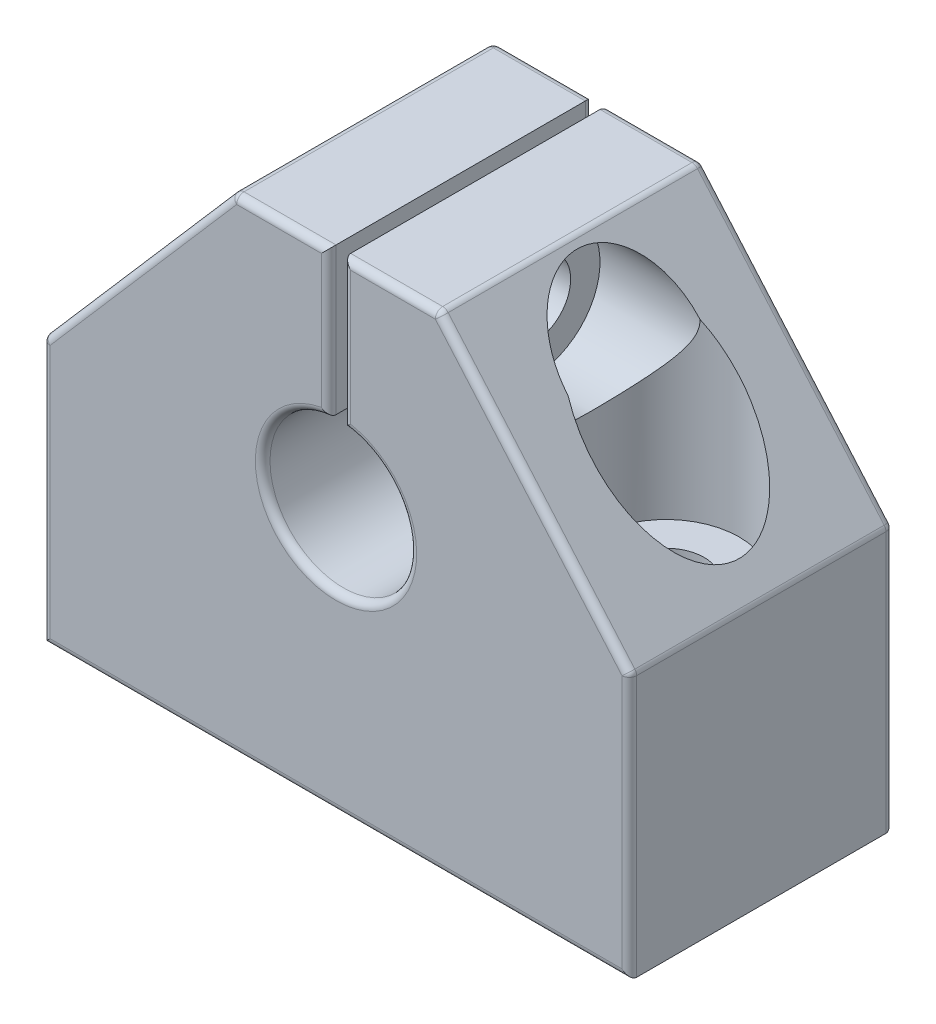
ISO-10303-21;
HEADER;
FILE_DESCRIPTION(('STEP AP214'),'2;1');
FILE_NAME('part.step','',(''),(''),'','','');
FILE_SCHEMA(('AUTOMOTIVE_DESIGN { 1 0 10303 214 1 1 1 1 }'));
ENDSEC;
DATA;
#1=APPLICATION_CONTEXT('core data for automotive mechanical design processes');
#2=APPLICATION_PROTOCOL_DEFINITION('international standard','automotive_design',2000,#1);
#3=PRODUCT_CONTEXT('',#1,'mechanical');
#4=PRODUCT('Part','Part','',(#3));
#5=PRODUCT_RELATED_PRODUCT_CATEGORY('part','',(#4));
#6=PRODUCT_DEFINITION_FORMATION('','',#4);
#7=PRODUCT_DEFINITION_CONTEXT('part definition',#1,'design');
#8=PRODUCT_DEFINITION('design','',#6,#7);
#9=PRODUCT_DEFINITION_SHAPE('','',#8);
#10=(LENGTH_UNIT() NAMED_UNIT(*) SI_UNIT(.MILLI.,.METRE.));
#11=(NAMED_UNIT(*) PLANE_ANGLE_UNIT() SI_UNIT($,.RADIAN.));
#12=(NAMED_UNIT(*) SI_UNIT($,.STERADIAN.) SOLID_ANGLE_UNIT());
#13=UNCERTAINTY_MEASURE_WITH_UNIT(LENGTH_MEASURE(1.E-05),#10,'distance_accuracy_value','');
#14=(GEOMETRIC_REPRESENTATION_CONTEXT(3) GLOBAL_UNCERTAINTY_ASSIGNED_CONTEXT((#13)) GLOBAL_UNIT_ASSIGNED_CONTEXT((#10,
#11,#12)) REPRESENTATION_CONTEXT('',''));
#15=CARTESIAN_POINT('',(0.,0.,0.));
#16=DIRECTION('',(0.,0.,1.));
#17=DIRECTION('',(1.,0.,0.));
#18=AXIS2_PLACEMENT_3D('',#15,#16,#17);
#19=CARTESIAN_POINT('',(6.5,33.,0.));
#20=DIRECTION('',(0.,-1.,0.));
#21=DIRECTION('',(0.,0.,-1.));
#22=AXIS2_PLACEMENT_3D('',#19,#20,#21);
#23=CYLINDRICAL_SURFACE('',#22,5.);
#24=CARTESIAN_POINT('',(6.5,16.,0.));
#25=DIRECTION('',(0.,1.,0.));
#26=DIRECTION('',(0.,0.,-1.));
#27=AXIS2_PLACEMENT_3D('',#24,#25,#26);
#28=CIRCLE('',#27,5.);
#29=CARTESIAN_POINT('',(6.5,16.,-5.));
#30=VERTEX_POINT('',#29);
#31=EDGE_CURVE('E575',#30,#30,#28,.T.);
#32=ORIENTED_EDGE('',*,*,#31,.F.);
#33=EDGE_LOOP('',(#32));
#34=FACE_BOUND('',#33,.T.);
#35=CARTESIAN_POINT('',(6.5,25.5,0.));
#36=DIRECTION('',(-0.755689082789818,0.654930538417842,0.));
#37=DIRECTION('',(-0.654930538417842,-0.755689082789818,0.));
#38=AXIS2_PLACEMENT_3D('',#35,#36,#37);
#39=ELLIPSE('',#38,7.634397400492,5.);
#40=CARTESIAN_POINT('',(1.5,19.7307692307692,0.));
#41=VERTEX_POINT('',#40);
#42=EDGE_CURVE('E230',#41,#41,#39,.F.);
#43=ORIENTED_EDGE('',*,*,#42,.F.);
#44=EDGE_LOOP('',(#43));
#45=FACE_BOUND('',#44,.T.);
#46=CARTESIAN_POINT('',(10.8301270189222,27.9874685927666,2.5));
#47=CARTESIAN_POINT('',(10.8301398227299,27.8572020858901,2.49998948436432));
#48=CARTESIAN_POINT('',(10.8360954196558,27.7267658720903,2.48974954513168));
#49=CARTESIAN_POINT('',(10.8590587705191,27.4698996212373,2.44930840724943));
#50=CARTESIAN_POINT('',(10.8760897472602,27.3434785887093,2.41906526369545));
#51=CARTESIAN_POINT('',(10.9187337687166,27.0988396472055,2.3402497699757));
#52=CARTESIAN_POINT('',(10.9443011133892,26.9805820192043,2.29177485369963));
#53=CARTESIAN_POINT('',(11.0010665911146,26.753908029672,2.17816884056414));
#54=CARTESIAN_POINT('',(11.0322650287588,26.6454922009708,2.11303684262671));
#55=CARTESIAN_POINT('',(11.0999217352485,26.4317042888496,1.96166634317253));
#56=CARTESIAN_POINT('',(11.1366015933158,26.3273207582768,1.87413008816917));
#57=CARTESIAN_POINT('',(11.2092995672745,26.1339476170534,1.68313452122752));
#58=CARTESIAN_POINT('',(11.2453173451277,26.0449656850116,1.57966731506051));
#59=CARTESIAN_POINT('',(11.3155369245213,25.8790507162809,1.35122390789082));
#60=CARTESIAN_POINT('',(11.3494526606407,25.8033341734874,1.22526797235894));
#61=CARTESIAN_POINT('',(11.4087689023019,25.6746164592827,0.960392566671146));
#62=CARTESIAN_POINT('',(11.4341747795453,25.6216009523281,0.821481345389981));
#63=CARTESIAN_POINT('',(11.4720115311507,25.5437069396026,0.545112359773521));
#64=CARTESIAN_POINT('',(11.4852370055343,25.5170947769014,0.408254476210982));
#65=CARTESIAN_POINT('',(11.5001895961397,25.4870532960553,0.131426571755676));
#66=CARTESIAN_POINT('',(11.5019236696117,25.4836099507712,-0.00854151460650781));
#67=CARTESIAN_POINT('',(11.4940745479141,25.499335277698,-0.274581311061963));
#68=CARTESIAN_POINT('',(11.4854623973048,25.5165636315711,-0.400802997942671));
#69=CARTESIAN_POINT('',(11.4593561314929,25.5696707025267,-0.648284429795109));
#70=CARTESIAN_POINT('',(11.4418613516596,25.6055508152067,-0.769543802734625));
#71=CARTESIAN_POINT('',(11.3992895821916,25.6951750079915,-1.00577347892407));
#72=CARTESIAN_POINT('',(11.37411103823,25.7491593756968,-1.12063355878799));
#73=CARTESIAN_POINT('',(11.3184411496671,25.8731271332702,-1.33994200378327));
#74=CARTESIAN_POINT('',(11.2879479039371,25.9431162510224,-1.4443866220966));
#75=CARTESIAN_POINT('',(11.2211098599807,26.1047069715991,-1.6504341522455));
#76=CARTESIAN_POINT('',(11.1844843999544,26.1977261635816,-1.7508351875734));
#77=CARTESIAN_POINT('',(11.1113585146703,26.398942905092,-1.93526092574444));
#78=CARTESIAN_POINT('',(11.0748582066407,26.5071520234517,-2.01927302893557));
#79=CARTESIAN_POINT('',(11.0036039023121,26.7440890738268,-2.17376333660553));
#80=CARTESIAN_POINT('',(10.9691079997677,26.8736836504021,-2.24304328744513));
#81=CARTESIAN_POINT('',(10.9093862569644,27.144812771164,-2.35829778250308));
#82=CARTESIAN_POINT('',(10.8841507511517,27.2863346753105,-2.40429664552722));
#83=CARTESIAN_POINT('',(10.8486158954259,27.5655048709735,-2.4679505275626));
#84=CARTESIAN_POINT('',(10.8372913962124,27.7025713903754,-2.48756280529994));
#85=CARTESIAN_POINT('',(10.8279479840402,27.9784719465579,-2.50379236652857));
#86=CARTESIAN_POINT('',(10.8299196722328,28.117304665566,-2.50042589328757));
#87=CARTESIAN_POINT('',(10.8458584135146,28.3766033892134,-2.47259010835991));
#88=CARTESIAN_POINT('',(10.8584896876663,28.4974172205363,-2.45046954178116));
#89=CARTESIAN_POINT('',(10.8923505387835,28.733388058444,-2.38924071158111));
#90=CARTESIAN_POINT('',(10.9135829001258,28.8485432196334,-2.35012694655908));
#91=CARTESIAN_POINT('',(10.9634055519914,29.0759969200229,-2.25411897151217));
#92=CARTESIAN_POINT('',(10.9922910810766,29.1879161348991,-2.19648515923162));
#93=CARTESIAN_POINT('',(11.0539029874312,29.4011417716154,-2.0657176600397));
#94=CARTESIAN_POINT('',(11.0866313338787,29.5024427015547,-1.99257601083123));
#95=CARTESIAN_POINT('',(11.1571999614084,29.7049155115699,-1.82209291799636));
#96=CARTESIAN_POINT('',(11.1951645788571,29.8044614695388,-1.72286318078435));
#97=CARTESIAN_POINT('',(11.2683558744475,29.9859991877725,-1.5085112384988));
#98=CARTESIAN_POINT('',(11.3035816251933,30.0679850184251,-1.39338368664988));
#99=CARTESIAN_POINT('',(11.3685340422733,30.2139029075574,-1.14633840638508));
#100=CARTESIAN_POINT('',(11.3980910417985,30.277301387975,-1.01405774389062));
#101=CARTESIAN_POINT('',(11.4470838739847,30.3803133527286,-0.738805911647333));
#102=CARTESIAN_POINT('',(11.4665285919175,30.4199477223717,-0.595844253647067));
#103=CARTESIAN_POINT('',(11.4916877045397,30.470890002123,-0.317449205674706));
#104=CARTESIAN_POINT('',(11.4984981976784,30.4844632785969,-0.182528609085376));
#105=CARTESIAN_POINT('',(11.5010532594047,30.4895767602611,0.0878149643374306));
#106=CARTESIAN_POINT('',(11.4968017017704,30.4811246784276,0.223237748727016));
#107=CARTESIAN_POINT('',(11.4783492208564,30.443927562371,0.481344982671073));
#108=CARTESIAN_POINT('',(11.4648223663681,30.4165564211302,0.604280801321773));
#109=CARTESIAN_POINT('',(11.4298023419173,30.3441511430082,0.843614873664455));
#110=CARTESIAN_POINT('',(11.4083080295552,30.2991144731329,0.960012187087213));
#111=CARTESIAN_POINT('',(11.3581482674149,30.1906507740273,1.18855854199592));
#112=CARTESIAN_POINT('',(11.329215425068,30.1265195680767,1.30031295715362));
#113=CARTESIAN_POINT('',(11.2672033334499,29.982574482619,1.51193650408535));
#114=CARTESIAN_POINT('',(11.234122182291,29.9027534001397,1.61180014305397));
#115=CARTESIAN_POINT('',(11.1632152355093,29.7204727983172,1.8072854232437));
#116=CARTESIAN_POINT('',(11.1252448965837,29.6165508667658,1.90149582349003));
#117=CARTESIAN_POINT('',(11.0515769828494,29.3938533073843,2.07165660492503));
#118=CARTESIAN_POINT('',(11.0158814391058,29.2750646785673,2.1475908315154));
#119=CARTESIAN_POINT('',(10.9499898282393,29.0208324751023,2.28108393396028));
#120=CARTESIAN_POINT('',(10.9200032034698,28.884981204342,2.3379862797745));
#121=CARTESIAN_POINT('',(10.8837027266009,28.6742459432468,2.40494911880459));
#122=CARTESIAN_POINT('',(10.8730548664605,28.6029088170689,2.42419582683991));
#123=CARTESIAN_POINT('',(10.8550757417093,28.4584278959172,2.45635087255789));
#124=CARTESIAN_POINT('',(10.8477421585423,28.3852854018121,2.46926364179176));
#125=CARTESIAN_POINT('',(10.8382377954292,28.2579676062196,2.48591166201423));
#126=CARTESIAN_POINT('',(10.8352048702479,28.2040522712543,2.49118864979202));
#127=CARTESIAN_POINT('',(10.8311467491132,28.0959239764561,2.49823512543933));
#128=CARTESIAN_POINT('',(10.8301216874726,28.041710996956,2.50000437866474));
#129=CARTESIAN_POINT('',(10.8301270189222,27.9874685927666,2.5));
#130=B_SPLINE_CURVE_WITH_KNOTS('',3,(#46,#47,#48,#49,#50,#51,#52,#53,#54,#55,#56,#57,#58,#59,
#60,#61,#62,#63,#64,#65,#66,#67,#68,#69,#70,#71,#72,#73,#74,#75,#76,#77,#78,#79,#80,#81,#82,#83,
#84,#85,#86,#87,#88,#89,#90,#91,#92,#93,#94,#95,#96,#97,#98,#99,#100,#101,#102,#103,#104,#105,
#106,#107,#108,#109,#110,#111,#112,#113,#114,#115,#116,#117,#118,#119,#120,#121,#122,#123,#124,
#125,#126,#127,#128,#129),.UNSPECIFIED.,.T.,.F.,(4,2,2,2,2,2,2,2,2,2,2,2,2,2,2,2,2,2,2,2,2,2,2,
2,2,2,2,2,2,2,2,2,2,2,2,2,2,2,2,2,2,4),(0.,0.390580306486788,0.781982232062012,1.17132148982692,
1.5606818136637,1.98215578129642,2.40383927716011,2.85394730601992,3.30377067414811,
3.72158712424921,4.13915059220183,4.52040243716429,4.90168281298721,5.2882383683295,
5.67493248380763,6.09817978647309,6.52175120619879,6.97222104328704,7.42221935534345,
7.83655727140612,8.25060232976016,8.61935458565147,8.98822631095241,9.37418241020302,
9.76033715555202,10.1951685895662,10.6301466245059,11.076604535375,11.5226694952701,
11.927806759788,12.3328021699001,12.7111106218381,13.0894733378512,13.4840187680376,
13.8787457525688,14.3127560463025,14.7471485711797,15.195268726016,15.4189244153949,
15.6424233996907,15.8050484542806,15.9676843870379),.UNSPECIFIED.);
#131=CARTESIAN_POINT('',(10.8301270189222,27.9874685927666,2.5));
#132=VERTEX_POINT('',#131);
#133=EDGE_CURVE('E261',#132,#132,#130,.T.);
#134=ORIENTED_EDGE('',*,*,#133,.T.);
#135=EDGE_LOOP('',(#134));
#136=FACE_BOUND('',#135,.T.);
#137=ADVANCED_FACE('F33',(#34,#45,#136),#23,.F.);
#138=CARTESIAN_POINT('',(19.5,33.0250628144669,-9.));
#139=DIRECTION('',(-1.,0.,0.));
#140=DIRECTION('',(0.,0.,1.));
#141=AXIS2_PLACEMENT_3D('',#138,#139,#140);
#142=PLANE('',#141);
#143=DIRECTION('',(0.,0.,1.));
#144=VECTOR('',#143,1.);
#145=CARTESIAN_POINT('',(19.5,22.9749371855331,-9.));
#146=LINE('',#145,#144);
#147=CARTESIAN_POINT('',(19.5,22.9749371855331,-8.5));
#148=VERTEX_POINT('',#147);
#149=CARTESIAN_POINT('',(19.5,22.9749371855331,8.5));
#150=VERTEX_POINT('',#149);
#151=EDGE_CURVE('E268',#148,#150,#146,.T.);
#152=ORIENTED_EDGE('',*,*,#151,.F.);
#153=DIRECTION('',(0.,-1.,0.));
#154=VECTOR('',#153,1.);
#155=CARTESIAN_POINT('',(19.5,33.,-8.5));
#156=LINE('',#155,#154);
#157=CARTESIAN_POINT('',(19.5,33.,-8.5));
#158=VERTEX_POINT('',#157);
#159=EDGE_CURVE('E602',#148,#158,#156,.F.);
#160=ORIENTED_EDGE('',*,*,#159,.T.);
#161=DIRECTION('',(0.,0.,1.));
#162=VECTOR('',#161,1.);
#163=CARTESIAN_POINT('',(19.5,33.,-9.));
#164=LINE('',#163,#162);
#165=CARTESIAN_POINT('',(19.5,33.,8.5));
#166=VERTEX_POINT('',#165);
#167=EDGE_CURVE('E576',#158,#166,#164,.T.);
#168=ORIENTED_EDGE('',*,*,#167,.T.);
#169=DIRECTION('',(0.,-1.,0.));
#170=VECTOR('',#169,1.);
#171=CARTESIAN_POINT('',(19.5,33.0250628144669,8.5));
#172=LINE('',#171,#170);
#173=EDGE_CURVE('E599',#166,#150,#172,.T.);
#174=ORIENTED_EDGE('',*,*,#173,.T.);
#175=EDGE_LOOP('',(#152,#160,#168,#174));
#176=FACE_BOUND('',#175,.T.);
#177=CARTESIAN_POINT('',(19.5,27.9874685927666,0.));
#178=DIRECTION('',(-1.,0.,0.));
#179=DIRECTION('',(0.,0.,1.));
#180=AXIS2_PLACEMENT_3D('',#177,#178,#179);
#181=CIRCLE('',#180,2.5);
#182=CARTESIAN_POINT('',(19.5,27.9874685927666,2.5));
#183=VERTEX_POINT('',#182);
#184=EDGE_CURVE('E236',#183,#183,#181,.F.);
#185=ORIENTED_EDGE('',*,*,#184,.F.);
#186=EDGE_LOOP('',(#185));
#187=FACE_BOUND('',#186,.T.);
#188=ADVANCED_FACE('F258',(#176,#187),#142,.F.);
#189=CARTESIAN_POINT('',(20.5,33.0250628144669,-9.));
#190=DIRECTION('',(1.,0.,0.));
#191=DIRECTION('',(0.,0.,-1.));
#192=AXIS2_PLACEMENT_3D('',#189,#190,#191);
#193=PLANE('',#192);
#194=DIRECTION('',(0.,0.,-1.));
#195=VECTOR('',#194,1.);
#196=CARTESIAN_POINT('',(20.5,33.,-9.));
#197=LINE('',#196,#195);
#198=CARTESIAN_POINT('',(20.5,33.,8.5));
#199=VERTEX_POINT('',#198);
#200=CARTESIAN_POINT('',(20.5,33.,-8.5));
#201=VERTEX_POINT('',#200);
#202=EDGE_CURVE('E568',#199,#201,#197,.T.);
#203=ORIENTED_EDGE('',*,*,#202,.T.);
#204=DIRECTION('',(0.,1.,0.));
#205=VECTOR('',#204,1.);
#206=CARTESIAN_POINT('',(20.5,22.9749371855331,-8.5));
#207=LINE('',#206,#205);
#208=CARTESIAN_POINT('',(20.5,22.9749371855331,-8.5));
#209=VERTEX_POINT('',#208);
#210=EDGE_CURVE('E369',#201,#209,#207,.F.);
#211=ORIENTED_EDGE('',*,*,#210,.T.);
#212=DIRECTION('',(0.,0.,1.));
#213=VECTOR('',#212,1.);
#214=CARTESIAN_POINT('',(20.5,22.9749371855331,-9.));
#215=LINE('',#214,#213);
#216=CARTESIAN_POINT('',(20.5,22.9749371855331,8.5));
#217=VERTEX_POINT('',#216);
#218=EDGE_CURVE('E269',#209,#217,#215,.T.);
#219=ORIENTED_EDGE('',*,*,#218,.T.);
#220=DIRECTION('',(0.,1.,0.));
#221=VECTOR('',#220,1.);
#222=CARTESIAN_POINT('',(20.5,33.0250628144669,8.5));
#223=LINE('',#222,#221);
#224=EDGE_CURVE('E367',#217,#199,#223,.T.);
#225=ORIENTED_EDGE('',*,*,#224,.T.);
#226=EDGE_LOOP('',(#203,#211,#219,#225));
#227=FACE_BOUND('',#226,.T.);
#228=CARTESIAN_POINT('',(20.5,27.9874685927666,0.));
#229=DIRECTION('',(1.,0.,0.));
#230=DIRECTION('',(0.,0.,-1.));
#231=AXIS2_PLACEMENT_3D('',#228,#229,#230);
#232=CIRCLE('',#231,2.5);
#233=CARTESIAN_POINT('',(20.5,27.9874685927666,-2.5));
#234=VERTEX_POINT('',#233);
#235=EDGE_CURVE('E213',#234,#234,#232,.F.);
#236=ORIENTED_EDGE('',*,*,#235,.F.);
#237=EDGE_LOOP('',(#236));
#238=FACE_BOUND('',#237,.T.);
#239=ADVANCED_FACE('F554',(#227,#238),#193,.F.);
#240=CARTESIAN_POINT('',(13.,33.,-9.));
#241=DIRECTION('',(0.,1.,0.));
#242=DIRECTION('',(0.,0.,1.));
#243=AXIS2_PLACEMENT_3D('',#240,#241,#242);
#244=PLANE('',#243);
#245=DIRECTION('',(0.,0.,1.));
#246=VECTOR('',#245,1.);
#247=CARTESIAN_POINT('',(26.771685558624,33.,-9.));
#248=LINE('',#247,#246);
#249=CARTESIAN_POINT('',(26.771685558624,33.,8.5));
#250=VERTEX_POINT('',#249);
#251=CARTESIAN_POINT('',(26.771685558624,33.,-8.5));
#252=VERTEX_POINT('',#251);
#253=EDGE_CURVE('E361',#250,#252,#248,.F.);
#254=ORIENTED_EDGE('',*,*,#253,.T.);
#255=DIRECTION('',(-1.,0.,0.));
#256=VECTOR('',#255,1.);
#257=CARTESIAN_POINT('',(13.,33.,-8.5));
#258=LINE('',#257,#256);
#259=EDGE_CURVE('E365',#252,#201,#258,.T.);
#260=ORIENTED_EDGE('',*,*,#259,.T.);
#261=ORIENTED_EDGE('',*,*,#202,.F.);
#262=DIRECTION('',(-1.,0.,0.));
#263=VECTOR('',#262,1.);
#264=CARTESIAN_POINT('',(27.,33.,8.5));
#265=LINE('',#264,#263);
#266=EDGE_CURVE('E363',#199,#250,#265,.F.);
#267=ORIENTED_EDGE('',*,*,#266,.T.);
#268=EDGE_LOOP('',(#254,#260,#261,#267));
#269=FACE_BOUND('',#268,.T.);
#270=ADVANCED_FACE('F556',(#269),#244,.T.);
#271=CARTESIAN_POINT('',(13.,33.,-9.));
#272=DIRECTION('',(-0.755689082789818,0.654930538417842,0.));
#273=DIRECTION('',(-0.654930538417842,-0.755689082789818,0.));
#274=AXIS2_PLACEMENT_3D('',#271,#272,#273);
#275=PLANE('',#274);
#276=DIRECTION('',(-0.654930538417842,-0.755689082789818,0.));
#277=VECTOR('',#276,1.);
#278=CARTESIAN_POINT('',(13.,33.,8.5));
#279=LINE('',#278,#277);
#280=CARTESIAN_POINT('',(0.122155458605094,18.1409486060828,8.5));
#281=VERTEX_POINT('',#280);
#282=CARTESIAN_POINT('',(12.8504698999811,32.8274652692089,8.5));
#283=VERTEX_POINT('',#282);
#284=EDGE_CURVE('E616',#281,#283,#279,.F.);
#285=ORIENTED_EDGE('',*,*,#284,.T.);
#286=DIRECTION('',(0.,0.,1.));
#287=VECTOR('',#286,1.);
#288=CARTESIAN_POINT('',(12.8504698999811,32.8274652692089,-9.));
#289=LINE('',#288,#287);
#290=CARTESIAN_POINT('',(12.8504698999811,32.8274652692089,-8.5));
#291=VERTEX_POINT('',#290);
#292=EDGE_CURVE('E339',#283,#291,#289,.F.);
#293=ORIENTED_EDGE('',*,*,#292,.T.);
#294=DIRECTION('',(-0.654930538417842,-0.755689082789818,0.));
#295=VECTOR('',#294,1.);
#296=CARTESIAN_POINT('',(13.,33.,-8.5));
#297=LINE('',#296,#295);
#298=CARTESIAN_POINT('',(0.122155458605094,18.1409486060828,-8.5));
#299=VERTEX_POINT('',#298);
#300=EDGE_CURVE('E618',#291,#299,#297,.T.);
#301=ORIENTED_EDGE('',*,*,#300,.T.);
#302=DIRECTION('',(0.,0.,1.));
#303=VECTOR('',#302,1.);
#304=CARTESIAN_POINT('',(0.122155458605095,18.1409486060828,-9.));
#305=LINE('',#304,#303);
#306=EDGE_CURVE('E614',#299,#281,#305,.T.);
#307=ORIENTED_EDGE('',*,*,#306,.T.);
#308=EDGE_LOOP('',(#285,#293,#301,#307));
#309=FACE_BOUND('',#308,.T.);
#310=ORIENTED_EDGE('',*,*,#42,.T.);
#311=EDGE_LOOP('',(#310));
#312=FACE_BOUND('',#311,.T.);
#313=ADVANCED_FACE('F301',(#309,#312),#275,.T.);
#314=CARTESIAN_POINT('',(0.,0.,-9.));
#315=DIRECTION('',(0.,-1.,0.));
#316=DIRECTION('',(0.,0.,-1.));
#317=AXIS2_PLACEMENT_3D('',#314,#315,#316);
#318=PLANE('',#317);
#319=DIRECTION('',(0.,0.,1.));
#320=VECTOR('',#319,1.);
#321=CARTESIAN_POINT('',(0.,0.,-9.));
#322=LINE('',#321,#320);
#323=CARTESIAN_POINT('',(0.,0.,-8.5));
#324=VERTEX_POINT('',#323);
#325=CARTESIAN_POINT('',(0.,0.,8.5));
#326=VERTEX_POINT('',#325);
#327=EDGE_CURVE('E222',#324,#326,#322,.T.);
#328=ORIENTED_EDGE('',*,*,#327,.F.);
#329=DIRECTION('',(1.,0.,0.));
#330=VECTOR('',#329,1.);
#331=CARTESIAN_POINT('',(0.,0.,-8.5));
#332=LINE('',#331,#330);
#333=CARTESIAN_POINT('',(40.,0.,-8.5));
#334=VERTEX_POINT('',#333);
#335=EDGE_CURVE('E344',#324,#334,#332,.T.);
#336=ORIENTED_EDGE('',*,*,#335,.T.);
#337=DIRECTION('',(0.,0.,1.));
#338=VECTOR('',#337,1.);
#339=CARTESIAN_POINT('',(40.,0.,-9.));
#340=LINE('',#339,#338);
#341=CARTESIAN_POINT('',(40.,0.,8.5));
#342=VERTEX_POINT('',#341);
#343=EDGE_CURVE('E208',#334,#342,#340,.T.);
#344=ORIENTED_EDGE('',*,*,#343,.T.);
#345=DIRECTION('',(1.,0.,0.));
#346=VECTOR('',#345,1.);
#347=CARTESIAN_POINT('',(0.,0.,8.5));
#348=LINE('',#347,#346);
#349=EDGE_CURVE('E326',#342,#326,#348,.F.);
#350=ORIENTED_EDGE('',*,*,#349,.T.);
#351=EDGE_LOOP('',(#328,#336,#344,#350));
#352=FACE_BOUND('',#351,.T.);
#353=CARTESIAN_POINT('',(33.5,0.,0.));
#354=DIRECTION('',(0.,-1.,0.));
#355=DIRECTION('',(0.,0.,-1.));
#356=AXIS2_PLACEMENT_3D('',#353,#354,#355);
#357=CIRCLE('',#356,2.6);
#358=CARTESIAN_POINT('',(33.5,0.,-2.6));
#359=VERTEX_POINT('',#358);
#360=EDGE_CURVE('E218',#359,#359,#357,.T.);
#361=ORIENTED_EDGE('',*,*,#360,.F.);
#362=EDGE_LOOP('',(#361));
#363=FACE_BOUND('',#362,.T.);
#364=CARTESIAN_POINT('',(6.5,0.,0.));
#365=DIRECTION('',(0.,1.,0.));
#366=DIRECTION('',(0.,0.,-1.));
#367=AXIS2_PLACEMENT_3D('',#364,#365,#366);
#368=CIRCLE('',#367,2.6);
#369=CARTESIAN_POINT('',(6.5,0.,-2.6));
#370=VERTEX_POINT('',#369);
#371=EDGE_CURVE('E233',#370,#370,#368,.T.);
#372=ORIENTED_EDGE('',*,*,#371,.T.);
#373=EDGE_LOOP('',(#372));
#374=FACE_BOUND('',#373,.T.);
#375=ADVANCED_FACE('F297',(#352,#363,#374),#318,.T.);
#376=CARTESIAN_POINT('',(0.,0.,-9.));
#377=DIRECTION('',(-1.,0.,0.));
#378=DIRECTION('',(0.,0.,1.));
#379=AXIS2_PLACEMENT_3D('',#376,#377,#378);
#380=PLANE('',#379);
#381=DIRECTION('',(0.,0.,1.));
#382=VECTOR('',#381,1.);
#383=CARTESIAN_POINT('',(0.,17.8134833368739,-9.));
#384=LINE('',#383,#382);
#385=CARTESIAN_POINT('',(0.,17.8134833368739,8.5));
#386=VERTEX_POINT('',#385);
#387=CARTESIAN_POINT('',(0.,17.8134833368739,-8.5));
#388=VERTEX_POINT('',#387);
#389=EDGE_CURVE('E336',#386,#388,#384,.F.);
#390=ORIENTED_EDGE('',*,*,#389,.T.);
#391=DIRECTION('',(0.,-1.,0.));
#392=VECTOR('',#391,1.);
#393=CARTESIAN_POINT('',(0.,0.,-8.5));
#394=LINE('',#393,#392);
#395=EDGE_CURVE('E323',#388,#324,#394,.T.);
#396=ORIENTED_EDGE('',*,*,#395,.T.);
#397=ORIENTED_EDGE('',*,*,#327,.T.);
#398=DIRECTION('',(0.,-1.,0.));
#399=VECTOR('',#398,1.);
#400=CARTESIAN_POINT('',(0.,18.,8.5));
#401=LINE('',#400,#399);
#402=EDGE_CURVE('E320',#326,#386,#401,.F.);
#403=ORIENTED_EDGE('',*,*,#402,.T.);
#404=EDGE_LOOP('',(#390,#396,#397,#403));
#405=FACE_BOUND('',#404,.T.);
#406=ADVANCED_FACE('F300',(#405),#380,.T.);
#407=ORIENTED_EDGE('',*,*,#167,.F.);
#408=DIRECTION('',(-1.,0.,0.));
#409=VECTOR('',#408,1.);
#410=CARTESIAN_POINT('',(13.,33.,-8.5));
#411=LINE('',#410,#409);
#412=CARTESIAN_POINT('',(13.228314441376,33.,-8.5));
#413=VERTEX_POINT('',#412);
#414=EDGE_CURVE('E612',#158,#413,#411,.T.);
#415=ORIENTED_EDGE('',*,*,#414,.T.);
#416=DIRECTION('',(0.,0.,1.));
#417=VECTOR('',#416,1.);
#418=CARTESIAN_POINT('',(13.228314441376,33.,-9.));
#419=LINE('',#418,#417);
#420=CARTESIAN_POINT('',(13.228314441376,33.,8.5));
#421=VERTEX_POINT('',#420);
#422=EDGE_CURVE('E608',#413,#421,#419,.T.);
#423=ORIENTED_EDGE('',*,*,#422,.T.);
#424=DIRECTION('',(-1.,0.,0.));
#425=VECTOR('',#424,1.);
#426=CARTESIAN_POINT('',(19.5,33.,8.5));
#427=LINE('',#426,#425);
#428=EDGE_CURVE('E610',#421,#166,#427,.F.);
#429=ORIENTED_EDGE('',*,*,#428,.T.);
#430=EDGE_LOOP('',(#407,#415,#423,#429));
#431=FACE_BOUND('',#430,.T.);
#432=ADVANCED_FACE('F564',(#431),#244,.T.);
#433=CARTESIAN_POINT('',(27.,33.,-9.));
#434=DIRECTION('',(0.755689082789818,0.654930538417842,0.));
#435=DIRECTION('',(-0.654930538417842,0.755689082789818,0.));
#436=AXIS2_PLACEMENT_3D('',#433,#434,#435);
#437=PLANE('',#436);
#438=DIRECTION('',(-0.654930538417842,0.755689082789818,0.));
#439=VECTOR('',#438,1.);
#440=CARTESIAN_POINT('',(27.,33.,-8.5));
#441=LINE('',#440,#439);
#442=CARTESIAN_POINT('',(39.8778445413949,18.1409486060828,-8.5));
#443=VERTEX_POINT('',#442);
#444=CARTESIAN_POINT('',(27.1495301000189,32.8274652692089,-8.5));
#445=VERTEX_POINT('',#444);
#446=EDGE_CURVE('E356',#443,#445,#441,.T.);
#447=ORIENTED_EDGE('',*,*,#446,.T.);
#448=DIRECTION('',(0.,0.,1.));
#449=VECTOR('',#448,1.);
#450=CARTESIAN_POINT('',(27.1495301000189,32.8274652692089,-9.));
#451=LINE('',#450,#449);
#452=CARTESIAN_POINT('',(27.1495301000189,32.8274652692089,8.5));
#453=VERTEX_POINT('',#452);
#454=EDGE_CURVE('E359',#445,#453,#451,.T.);
#455=ORIENTED_EDGE('',*,*,#454,.T.);
#456=DIRECTION('',(-0.654930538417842,0.755689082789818,0.));
#457=VECTOR('',#456,1.);
#458=CARTESIAN_POINT('',(40.,18.,8.5));
#459=LINE('',#458,#457);
#460=CARTESIAN_POINT('',(39.8778445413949,18.1409486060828,8.5));
#461=VERTEX_POINT('',#460);
#462=EDGE_CURVE('E354',#453,#461,#459,.F.);
#463=ORIENTED_EDGE('',*,*,#462,.T.);
#464=DIRECTION('',(0.,0.,1.));
#465=VECTOR('',#464,1.);
#466=CARTESIAN_POINT('',(39.8778445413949,18.1409486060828,-9.));
#467=LINE('',#466,#465);
#468=EDGE_CURVE('E352',#461,#443,#467,.F.);
#469=ORIENTED_EDGE('',*,*,#468,.T.);
#470=EDGE_LOOP('',(#447,#455,#463,#469));
#471=FACE_BOUND('',#470,.T.);
#472=CARTESIAN_POINT('',(31.344193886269,27.9874685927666,0.));
#473=DIRECTION('',(0.755689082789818,0.654930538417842,0.));
#474=DIRECTION('',(-0.654930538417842,0.755689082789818,0.));
#475=AXIS2_PLACEMENT_3D('',#472,#473,#474);
#476=ELLIPSE('',#475,5.95482997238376,4.5);
#477=CARTESIAN_POINT('',(31.3203772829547,28.0149492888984,-4.49991608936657));
#478=VERTEX_POINT('',#477);
#479=CARTESIAN_POINT('',(31.3203772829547,28.0149492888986,4.49991608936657));
#480=VERTEX_POINT('',#479);
#481=EDGE_CURVE('E203',#478,#480,#476,.T.);
#482=ORIENTED_EDGE('',*,*,#481,.F.);
#483=CARTESIAN_POINT('',(33.5,25.5,0.));
#484=DIRECTION('',(0.755689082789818,0.654930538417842,0.));
#485=DIRECTION('',(0.654930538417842,-0.755689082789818,0.));
#486=AXIS2_PLACEMENT_3D('',#483,#484,#485);
#487=ELLIPSE('',#486,7.634397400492,5.);
#488=EDGE_CURVE('E212',#480,#478,#487,.T.);
#489=ORIENTED_EDGE('',*,*,#488,.F.);
#490=EDGE_LOOP('',(#482,#489));
#491=FACE_BOUND('',#490,.T.);
#492=ADVANCED_FACE('F211',(#471,#491),#437,.T.);
#493=CARTESIAN_POINT('',(40.,0.,-9.));
#494=DIRECTION('',(1.,0.,0.));
#495=DIRECTION('',(0.,0.,-1.));
#496=AXIS2_PLACEMENT_3D('',#493,#494,#495);
#497=PLANE('',#496);
#498=ORIENTED_EDGE('',*,*,#343,.F.);
#499=DIRECTION('',(0.,1.,0.));
#500=VECTOR('',#499,1.);
#501=CARTESIAN_POINT('',(40.,0.,-8.5));
#502=LINE('',#501,#500);
#503=CARTESIAN_POINT('',(40.,17.8134833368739,-8.5));
#504=VERTEX_POINT('',#503);
#505=EDGE_CURVE('E350',#334,#504,#502,.T.);
#506=ORIENTED_EDGE('',*,*,#505,.T.);
#507=DIRECTION('',(0.,0.,1.));
#508=VECTOR('',#507,1.);
#509=CARTESIAN_POINT('',(40.,17.8134833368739,-9.));
#510=LINE('',#509,#508);
#511=CARTESIAN_POINT('',(40.,17.8134833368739,8.5));
#512=VERTEX_POINT('',#511);
#513=EDGE_CURVE('E346',#504,#512,#510,.T.);
#514=ORIENTED_EDGE('',*,*,#513,.T.);
#515=DIRECTION('',(0.,1.,0.));
#516=VECTOR('',#515,1.);
#517=CARTESIAN_POINT('',(40.,0.,8.5));
#518=LINE('',#517,#516);
#519=EDGE_CURVE('E348',#512,#342,#518,.F.);
#520=ORIENTED_EDGE('',*,*,#519,.T.);
#521=EDGE_LOOP('',(#498,#506,#514,#520));
#522=FACE_BOUND('',#521,.T.);
#523=ADVANCED_FACE('F825',(#522),#497,.T.);
#524=CARTESIAN_POINT('',(0.,0.,-9.));
#525=DIRECTION('',(0.,0.,-1.));
#526=DIRECTION('',(-1.,0.,0.));
#527=AXIS2_PLACEMENT_3D('',#524,#525,#526);
#528=PLANE('',#527);
#529=DIRECTION('',(0.,-1.,0.));
#530=VECTOR('',#529,1.);
#531=CARTESIAN_POINT('',(19.,22.9749371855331,-9.));
#532=LINE('',#531,#530);
#533=CARTESIAN_POINT('',(19.,32.5,-9.));
#534=VERTEX_POINT('',#533);
#535=CARTESIAN_POINT('',(19.,23.408326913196,-9.));
#536=VERTEX_POINT('',#535);
#537=EDGE_CURVE('E733',#534,#536,#532,.T.);
#538=ORIENTED_EDGE('',*,*,#537,.T.);
#539=CARTESIAN_POINT('',(20.,18.,-9.));
#540=DIRECTION('',(0.,0.,-1.));
#541=DIRECTION('',(-1.,0.,0.));
#542=AXIS2_PLACEMENT_3D('',#539,#540,#541);
#543=CIRCLE('',#542,5.5);
#544=CARTESIAN_POINT('',(21.,23.408326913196,-9.));
#545=VERTEX_POINT('',#544);
#546=EDGE_CURVE('E591',#536,#545,#543,.F.);
#547=ORIENTED_EDGE('',*,*,#546,.T.);
#548=DIRECTION('',(0.,1.,0.));
#549=VECTOR('',#548,1.);
#550=CARTESIAN_POINT('',(21.,33.,-9.));
#551=LINE('',#550,#549);
#552=CARTESIAN_POINT('',(21.,32.5,-9.));
#553=VERTEX_POINT('',#552);
#554=EDGE_CURVE('E207',#545,#553,#551,.T.);
#555=ORIENTED_EDGE('',*,*,#554,.T.);
#556=DIRECTION('',(-1.,0.,0.));
#557=VECTOR('',#556,1.);
#558=CARTESIAN_POINT('',(0.,32.5,-9.));
#559=LINE('',#558,#557);
#560=CARTESIAN_POINT('',(26.771685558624,32.5,-9.));
#561=VERTEX_POINT('',#560);
#562=EDGE_CURVE('E583',#553,#561,#559,.F.);
#563=ORIENTED_EDGE('',*,*,#562,.T.);
#564=DIRECTION('',(-0.654930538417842,0.755689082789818,0.));
#565=VECTOR('',#564,1.);
#566=CARTESIAN_POINT('',(31.3734244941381,27.190301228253,-9.));
#567=LINE('',#566,#565);
#568=CARTESIAN_POINT('',(39.5,17.8134833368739,-9.));
#569=VERTEX_POINT('',#568);
#570=EDGE_CURVE('E1090',#561,#569,#567,.F.);
#571=ORIENTED_EDGE('',*,*,#570,.T.);
#572=DIRECTION('',(0.,1.,0.));
#573=VECTOR('',#572,1.);
#574=CARTESIAN_POINT('',(39.5,0.,-9.));
#575=LINE('',#574,#573);
#576=CARTESIAN_POINT('',(39.5,0.5,-9.));
#577=VERTEX_POINT('',#576);
#578=EDGE_CURVE('E1087',#569,#577,#575,.F.);
#579=ORIENTED_EDGE('',*,*,#578,.T.);
#580=DIRECTION('',(1.,0.,0.));
#581=VECTOR('',#580,1.);
#582=CARTESIAN_POINT('',(0.,0.5,-9.));
#583=LINE('',#582,#581);
#584=CARTESIAN_POINT('',(0.5,0.5,-9.));
#585=VERTEX_POINT('',#584);
#586=EDGE_CURVE('E1092',#577,#585,#583,.F.);
#587=ORIENTED_EDGE('',*,*,#586,.T.);
#588=DIRECTION('',(0.,-1.,0.));
#589=VECTOR('',#588,1.);
#590=CARTESIAN_POINT('',(0.5,0.,-9.));
#591=LINE('',#590,#589);
#592=CARTESIAN_POINT('',(0.5,17.8134833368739,-9.));
#593=VERTEX_POINT('',#592);
#594=EDGE_CURVE('E1077',#585,#593,#591,.F.);
#595=ORIENTED_EDGE('',*,*,#594,.T.);
#596=DIRECTION('',(-0.654930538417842,-0.755689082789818,0.));
#597=VECTOR('',#596,1.);
#598=CARTESIAN_POINT('',(-8.53078490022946,7.39334691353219,-9.));
#599=LINE('',#598,#597);
#600=CARTESIAN_POINT('',(13.228314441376,32.5,-9.));
#601=VERTEX_POINT('',#600);
#602=EDGE_CURVE('E1097',#593,#601,#599,.F.);
#603=ORIENTED_EDGE('',*,*,#602,.T.);
#604=DIRECTION('',(-1.,0.,0.));
#605=VECTOR('',#604,1.);
#606=CARTESIAN_POINT('',(0.,32.5,-9.));
#607=LINE('',#606,#605);
#608=EDGE_CURVE('E735',#601,#534,#607,.F.);
#609=ORIENTED_EDGE('',*,*,#608,.T.);
#610=EDGE_LOOP('',(#538,#547,#555,#563,#571,#579,#587,#595,#603,#609));
#611=FACE_BOUND('',#610,.T.);
#612=ADVANCED_FACE('F835',(#611),#528,.T.);
#613=CARTESIAN_POINT('',(0.,0.,9.));
#614=DIRECTION('',(0.,0.,-1.));
#615=DIRECTION('',(-1.,0.,0.));
#616=AXIS2_PLACEMENT_3D('',#613,#614,#615);
#617=PLANE('',#616);
#618=DIRECTION('',(0.,1.,0.));
#619=VECTOR('',#618,1.);
#620=CARTESIAN_POINT('',(39.5,18.,9.));
#621=LINE('',#620,#619);
#622=CARTESIAN_POINT('',(39.5,0.5,9.));
#623=VERTEX_POINT('',#622);
#624=CARTESIAN_POINT('',(39.5,17.8134833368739,9.));
#625=VERTEX_POINT('',#624);
#626=EDGE_CURVE('E42',#623,#625,#621,.T.);
#627=ORIENTED_EDGE('',*,*,#626,.T.);
#628=DIRECTION('',(-0.654930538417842,0.755689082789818,0.));
#629=VECTOR('',#628,1.);
#630=CARTESIAN_POINT('',(26.6221554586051,32.6725347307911,9.));
#631=LINE('',#630,#629);
#632=CARTESIAN_POINT('',(26.771685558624,32.5,9.));
#633=VERTEX_POINT('',#632);
#634=EDGE_CURVE('E11',#625,#633,#631,.T.);
#635=ORIENTED_EDGE('',*,*,#634,.T.);
#636=DIRECTION('',(-1.,0.,0.));
#637=VECTOR('',#636,1.);
#638=CARTESIAN_POINT('',(20.5,32.5,9.));
#639=LINE('',#638,#637);
#640=CARTESIAN_POINT('',(21.,32.5,9.));
#641=VERTEX_POINT('',#640);
#642=EDGE_CURVE('E371',#633,#641,#639,.T.);
#643=ORIENTED_EDGE('',*,*,#642,.T.);
#644=DIRECTION('',(0.,1.,0.));
#645=VECTOR('',#644,1.);
#646=CARTESIAN_POINT('',(21.,0.,9.));
#647=LINE('',#646,#645);
#648=CARTESIAN_POINT('',(21.,23.408326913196,9.));
#649=VERTEX_POINT('',#648);
#650=EDGE_CURVE('E373',#641,#649,#647,.F.);
#651=ORIENTED_EDGE('',*,*,#650,.T.);
#652=CARTESIAN_POINT('',(20.,18.,9.));
#653=DIRECTION('',(0.,0.,-1.));
#654=DIRECTION('',(-1.,0.,0.));
#655=AXIS2_PLACEMENT_3D('',#652,#653,#654);
#656=CIRCLE('',#655,5.5);
#657=CARTESIAN_POINT('',(19.,23.408326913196,9.));
#658=VERTEX_POINT('',#657);
#659=EDGE_CURVE('E375',#649,#658,#656,.T.);
#660=ORIENTED_EDGE('',*,*,#659,.T.);
#661=DIRECTION('',(0.,-1.,0.));
#662=VECTOR('',#661,1.);
#663=CARTESIAN_POINT('',(19.,0.,9.));
#664=LINE('',#663,#662);
#665=CARTESIAN_POINT('',(19.,32.5,9.));
#666=VERTEX_POINT('',#665);
#667=EDGE_CURVE('E377',#658,#666,#664,.F.);
#668=ORIENTED_EDGE('',*,*,#667,.T.);
#669=DIRECTION('',(-1.,0.,0.));
#670=VECTOR('',#669,1.);
#671=CARTESIAN_POINT('',(13.,32.5,9.));
#672=LINE('',#671,#670);
#673=CARTESIAN_POINT('',(13.228314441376,32.5,9.));
#674=VERTEX_POINT('',#673);
#675=EDGE_CURVE('E379',#666,#674,#672,.T.);
#676=ORIENTED_EDGE('',*,*,#675,.T.);
#677=DIRECTION('',(-0.654930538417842,-0.755689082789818,0.));
#678=VECTOR('',#677,1.);
#679=CARTESIAN_POINT('',(0.37784454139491,17.6725347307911,9.));
#680=LINE('',#679,#678);
#681=CARTESIAN_POINT('',(0.500000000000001,17.8134833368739,9.));
#682=VERTEX_POINT('',#681);
#683=EDGE_CURVE('E381',#674,#682,#680,.T.);
#684=ORIENTED_EDGE('',*,*,#683,.T.);
#685=DIRECTION('',(0.,-1.,0.));
#686=VECTOR('',#685,1.);
#687=CARTESIAN_POINT('',(0.5,0.,9.));
#688=LINE('',#687,#686);
#689=CARTESIAN_POINT('',(0.5,0.5,9.));
#690=VERTEX_POINT('',#689);
#691=EDGE_CURVE('E383',#682,#690,#688,.T.);
#692=ORIENTED_EDGE('',*,*,#691,.T.);
#693=DIRECTION('',(1.,0.,0.));
#694=VECTOR('',#693,1.);
#695=CARTESIAN_POINT('',(40.,0.5,9.));
#696=LINE('',#695,#694);
#697=EDGE_CURVE('E53',#690,#623,#696,.T.);
#698=ORIENTED_EDGE('',*,*,#697,.T.);
#699=EDGE_LOOP('',(#627,#635,#643,#651,#660,#668,#676,#684,#692,#698));
#700=FACE_BOUND('',#699,.T.);
#701=ADVANCED_FACE('F845',(#700),#617,.F.);
#702=CARTESIAN_POINT('',(20.,18.,-9.));
#703=DIRECTION('',(0.,0.,1.));
#704=DIRECTION('',(1.,0.,0.));
#705=AXIS2_PLACEMENT_3D('',#702,#703,#704);
#706=CYLINDRICAL_SURFACE('',#705,5.);
#707=ORIENTED_EDGE('',*,*,#218,.F.);
#708=CARTESIAN_POINT('',(20.,18.,-8.5));
#709=DIRECTION('',(0.,0.,-1.));
#710=DIRECTION('',(-1.,0.,0.));
#711=AXIS2_PLACEMENT_3D('',#708,#709,#710);
#712=CIRCLE('',#711,5.);
#713=EDGE_CURVE('E593',#209,#148,#712,.T.);
#714=ORIENTED_EDGE('',*,*,#713,.T.);
#715=ORIENTED_EDGE('',*,*,#151,.T.);
#716=CARTESIAN_POINT('',(20.,18.,8.5));
#717=DIRECTION('',(0.,0.,-1.));
#718=DIRECTION('',(-1.,0.,0.));
#719=AXIS2_PLACEMENT_3D('',#716,#717,#718);
#720=CIRCLE('',#719,5.);
#721=EDGE_CURVE('E600',#150,#217,#720,.F.);
#722=ORIENTED_EDGE('',*,*,#721,.T.);
#723=EDGE_LOOP('',(#707,#714,#715,#722));
#724=FACE_BOUND('',#723,.T.);
#725=ADVANCED_FACE('F288',(#724),#706,.F.);
#726=CARTESIAN_POINT('',(33.5,16.,0.));
#727=DIRECTION('',(0.,-1.,0.));
#728=DIRECTION('',(0.,0.,-1.));
#729=AXIS2_PLACEMENT_3D('',#726,#727,#728);
#730=CYLINDRICAL_SURFACE('',#729,2.6);
#731=CARTESIAN_POINT('',(33.5,16.,0.));
#732=DIRECTION('',(0.,-1.,0.));
#733=DIRECTION('',(0.,0.,-1.));
#734=AXIS2_PLACEMENT_3D('',#731,#732,#733);
#735=CIRCLE('',#734,2.6);
#736=CARTESIAN_POINT('',(33.5,16.,-2.6));
#737=VERTEX_POINT('',#736);
#738=EDGE_CURVE('E219',#737,#737,#735,.F.);
#739=ORIENTED_EDGE('',*,*,#738,.T.);
#740=EDGE_LOOP('',(#739));
#741=FACE_BOUND('',#740,.T.);
#742=ORIENTED_EDGE('',*,*,#360,.T.);
#743=EDGE_LOOP('',(#742));
#744=FACE_BOUND('',#743,.T.);
#745=ADVANCED_FACE('F282',(#741,#744),#730,.F.);
#746=CARTESIAN_POINT('',(33.5,16.,0.));
#747=DIRECTION('',(0.,-1.,0.));
#748=DIRECTION('',(0.,0.,-1.));
#749=AXIS2_PLACEMENT_3D('',#746,#747,#748);
#750=PLANE('',#749);
#751=CARTESIAN_POINT('',(33.5,16.,0.));
#752=DIRECTION('',(0.,-1.,0.));
#753=DIRECTION('',(0.,0.,-1.));
#754=AXIS2_PLACEMENT_3D('',#751,#752,#753);
#755=CIRCLE('',#754,5.);
#756=CARTESIAN_POINT('',(33.5,16.,-5.));
#757=VERTEX_POINT('',#756);
#758=EDGE_CURVE('E225',#757,#757,#755,.T.);
#759=ORIENTED_EDGE('',*,*,#758,.F.);
#760=EDGE_LOOP('',(#759));
#761=FACE_BOUND('',#760,.T.);
#762=ORIENTED_EDGE('',*,*,#738,.F.);
#763=EDGE_LOOP('',(#762));
#764=FACE_BOUND('',#763,.T.);
#765=ADVANCED_FACE('F280',(#761,#764),#750,.F.);
#766=CARTESIAN_POINT('',(33.5,33.,0.));
#767=DIRECTION('',(0.,-1.,0.));
#768=DIRECTION('',(0.,0.,-1.));
#769=AXIS2_PLACEMENT_3D('',#766,#767,#768);
#770=CYLINDRICAL_SURFACE('',#769,5.);
#771=ORIENTED_EDGE('',*,*,#488,.T.);
#772=CARTESIAN_POINT('',(29.4838231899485,31.3608461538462,-2.97830888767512));
#773=CARTESIAN_POINT('',(29.5302614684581,31.3055545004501,-3.04092838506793));
#774=CARTESIAN_POINT('',(29.5775515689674,31.2488584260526,-3.10163778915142));
#775=CARTESIAN_POINT('',(29.6735075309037,31.1328006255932,-3.21927313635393));
#776=CARTESIAN_POINT('',(29.72217308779,31.0734394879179,-3.27619990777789));
#777=CARTESIAN_POINT('',(29.8698396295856,30.8914531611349,-3.4414763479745));
#778=CARTESIAN_POINT('',(29.970446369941,30.7650007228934,-3.5442369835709));
#779=CARTESIAN_POINT('',(30.17412995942,30.5011400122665,-3.73609051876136));
#780=CARTESIAN_POINT('',(30.2772217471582,30.3636282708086,-3.82502402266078));
#781=CARTESIAN_POINT('',(30.481210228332,30.0786539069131,-3.98796699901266));
#782=CARTESIAN_POINT('',(30.5821088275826,29.9312004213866,-4.06198993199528));
#783=CARTESIAN_POINT('',(30.7622123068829,29.6474859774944,-4.18504554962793));
#784=CARTESIAN_POINT('',(30.8424244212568,29.5127717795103,-4.23615281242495));
#785=CARTESIAN_POINT('',(30.9921232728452,29.2337890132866,-4.32644624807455));
#786=CARTESIAN_POINT('',(31.0616304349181,29.0895394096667,-4.3656552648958));
#787=CARTESIAN_POINT('',(31.1686954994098,28.8220668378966,-4.42356537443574));
#788=CARTESIAN_POINT('',(31.209905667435,28.7009191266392,-4.44485666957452));
#789=CARTESIAN_POINT('',(31.2746013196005,28.452864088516,-4.47760502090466));
#790=CARTESIAN_POINT('',(31.298146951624,28.3259778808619,-4.48909546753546));
#791=CARTESIAN_POINT('',(31.322854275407,28.068041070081,-4.50114206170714));
#792=CARTESIAN_POINT('',(31.3237840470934,27.9369611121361,-4.5015849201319));
#793=CARTESIAN_POINT('',(31.3024011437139,27.677065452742,-4.49117571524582));
#794=CARTESIAN_POINT('',(31.2800408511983,27.5482549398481,-4.48030051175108));
#795=CARTESIAN_POINT('',(31.2086884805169,27.2636437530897,-4.44429972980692));
#796=CARTESIAN_POINT('',(31.1542332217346,27.1096699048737,-4.41617528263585));
#797=CARTESIAN_POINT('',(31.0275958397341,26.8122761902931,-4.34654282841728));
#798=CARTESIAN_POINT('',(30.9553457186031,26.6688996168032,-4.30498328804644));
#799=CARTESIAN_POINT('',(30.8058125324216,26.3999199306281,-4.21291322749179));
#800=CARTESIAN_POINT('',(30.7290820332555,26.2737670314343,-4.16307969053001));
#801=CARTESIAN_POINT('',(30.5711544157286,26.0286635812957,-4.05353125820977));
#802=CARTESIAN_POINT('',(30.489953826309,25.9097187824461,-3.993808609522));
#803=CARTESIAN_POINT('',(30.3257610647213,25.6782624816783,-3.86460202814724));
#804=CARTESIAN_POINT('',(30.2427664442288,25.565760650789,-3.79510393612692));
#805=CARTESIAN_POINT('',(30.0771170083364,25.347165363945,-3.64640417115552));
#806=CARTESIAN_POINT('',(29.994462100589,25.2410700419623,-3.5672053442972));
#807=CARTESIAN_POINT('',(29.8259463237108,25.0289087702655,-3.39365087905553));
#808=CARTESIAN_POINT('',(29.7402108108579,24.923264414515,-3.2986552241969));
#809=CARTESIAN_POINT('',(29.5726753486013,24.7198705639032,-3.09730293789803));
#810=CARTESIAN_POINT('',(29.4908764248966,24.6221231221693,-2.99094336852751));
#811=CARTESIAN_POINT('',(29.3332285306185,24.4357872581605,-2.76707195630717));
#812=CARTESIAN_POINT('',(29.2573622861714,24.3471719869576,-2.64959487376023));
#813=CARTESIAN_POINT('',(29.1132098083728,24.1801463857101,-2.40342145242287));
#814=CARTESIAN_POINT('',(29.0449186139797,24.1017293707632,-2.27473255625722));
#815=CARTESIAN_POINT('',(28.8994421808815,23.9356573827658,-1.96757518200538));
#816=CARTESIAN_POINT('',(28.8253639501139,23.8518509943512,-1.78544747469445));
#817=CARTESIAN_POINT('',(28.7294449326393,23.7438306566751,-1.50062958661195));
#818=CARTESIAN_POINT('',(28.7000003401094,23.7107669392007,-1.40373073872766));
#819=CARTESIAN_POINT('',(28.6466783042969,23.6510051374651,-1.20651576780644));
#820=CARTESIAN_POINT('',(28.6227982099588,23.6243040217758,-1.1062012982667));
#821=CARTESIAN_POINT('',(28.5809170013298,23.5775381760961,-0.901983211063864));
#822=CARTESIAN_POINT('',(28.5629625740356,23.5575261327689,-0.798057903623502));
#823=CARTESIAN_POINT('',(28.5335880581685,23.5248124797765,-0.588192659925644));
#824=CARTESIAN_POINT('',(28.5221649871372,23.5121075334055,-0.48225366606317));
#825=CARTESIAN_POINT('',(28.5061123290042,23.4942593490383,-0.269242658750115));
#826=CARTESIAN_POINT('',(28.5014816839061,23.4891149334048,-0.162170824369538));
#827=CARTESIAN_POINT('',(28.4991237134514,23.4864949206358,0.0521363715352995));
#828=CARTESIAN_POINT('',(28.5013957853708,23.4890186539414,0.159371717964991));
#829=CARTESIAN_POINT('',(28.5121759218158,23.5010006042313,0.36157100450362));
#830=CARTESIAN_POINT('',(28.5199899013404,23.5096870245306,0.456618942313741));
#831=CARTESIAN_POINT('',(28.5409186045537,23.5329749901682,0.645406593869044));
#832=CARTESIAN_POINT('',(28.5540349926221,23.5475783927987,0.739145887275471));
#833=CARTESIAN_POINT('',(28.6010030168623,23.5999387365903,1.01740027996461));
#834=CARTESIAN_POINT('',(28.6424832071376,23.6462564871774,1.19912284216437));
#835=CARTESIAN_POINT('',(28.7444588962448,23.7606656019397,1.55571810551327));
#836=CARTESIAN_POINT('',(28.8054513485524,23.8293269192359,1.73025954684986));
#837=CARTESIAN_POINT('',(28.9425690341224,23.9847814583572,2.06458869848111));
#838=CARTESIAN_POINT('',(29.0187006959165,24.0715823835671,2.2243700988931));
#839=CARTESIAN_POINT('',(29.2239027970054,24.3077896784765,2.60423440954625));
#840=CARTESIAN_POINT('',(29.3603896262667,24.4667775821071,2.81443670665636));
#841=CARTESIAN_POINT('',(29.5770306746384,24.7252802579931,3.10239961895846));
#842=CARTESIAN_POINT('',(29.6513828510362,24.8149750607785,3.19397899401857));
#843=CARTESIAN_POINT('',(29.8028712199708,25.0005561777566,3.36816382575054));
#844=CARTESIAN_POINT('',(29.8800069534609,25.0964414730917,3.45077075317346));
#845=CARTESIAN_POINT('',(30.0375597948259,25.296304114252,3.6089138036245));
#846=CARTESIAN_POINT('',(30.1180115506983,25.4004171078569,3.68424284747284));
#847=CARTESIAN_POINT('',(30.2789799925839,25.6147095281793,3.82576909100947));
#848=CARTESIAN_POINT('',(30.3594966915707,25.7248911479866,3.891962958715));
#849=CARTESIAN_POINT('',(30.5184782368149,25.9513030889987,4.01504716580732));
#850=CARTESIAN_POINT('',(30.5969473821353,26.067518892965,4.07195858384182));
#851=CARTESIAN_POINT('',(30.7493606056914,26.3068303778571,4.17642105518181));
#852=CARTESIAN_POINT('',(30.8233085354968,26.4299200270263,4.22398015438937));
#853=CARTESIAN_POINT('',(30.9582079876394,26.6757633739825,4.30640435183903));
#854=CARTESIAN_POINT('',(31.0196947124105,26.7980052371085,4.34189920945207));
#855=CARTESIAN_POINT('',(31.1302976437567,27.0502974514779,4.40323805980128));
#856=CARTESIAN_POINT('',(31.179433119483,27.1803352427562,4.42909711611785));
#857=CARTESIAN_POINT('',(31.2520888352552,27.4265975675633,4.4663537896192));
#858=CARTESIAN_POINT('',(31.2784514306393,27.5416982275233,4.4794043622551));
#859=CARTESIAN_POINT('',(31.3132527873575,27.7751568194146,4.49650384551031));
#860=CARTESIAN_POINT('',(31.3217285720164,27.8935075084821,4.50057135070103));
#861=CARTESIAN_POINT('',(31.3191000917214,28.1301619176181,4.49929671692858));
#862=CARTESIAN_POINT('',(31.3079576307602,28.2484650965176,4.49393622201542));
#863=CARTESIAN_POINT('',(31.2682522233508,28.4814023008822,4.47434570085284));
#864=CARTESIAN_POINT('',(31.2396524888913,28.5960280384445,4.46009694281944));
#865=CARTESIAN_POINT('',(31.1494390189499,28.883662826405,4.41345622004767));
#866=CARTESIAN_POINT('',(31.0782992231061,29.0526843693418,4.37535141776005));
#867=CARTESIAN_POINT('',(30.9587356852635,29.296290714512,4.30629347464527));
#868=CARTESIAN_POINT('',(30.9166075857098,29.3760402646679,4.28120673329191));
#869=CARTESIAN_POINT('',(30.8292417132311,29.5325123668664,4.22725378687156));
#870=CARTESIAN_POINT('',(30.7840046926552,29.6092356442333,4.19838849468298));
#871=CARTESIAN_POINT('',(30.6542257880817,29.8204987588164,4.11236909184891));
#872=CARTESIAN_POINT('',(30.5673258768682,29.9519257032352,4.05113038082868));
#873=CARTESIAN_POINT('',(30.390715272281,30.2069410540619,3.91722787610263));
#874=CARTESIAN_POINT('',(30.3010023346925,30.3305229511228,3.84455476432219));
#875=CARTESIAN_POINT('',(30.1217887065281,30.5698256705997,3.68806246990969));
#876=CARTESIAN_POINT('',(30.0322882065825,30.6855693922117,3.60427807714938));
#877=CARTESIAN_POINT('',(29.8553415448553,30.9094932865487,3.4252446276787));
#878=CARTESIAN_POINT('',(29.7678946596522,31.0176761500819,3.32999968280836));
#879=CARTESIAN_POINT('',(29.6486220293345,31.1629462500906,3.18898583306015));
#880=CARTESIAN_POINT('',(29.6151294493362,31.2034770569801,3.14811477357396));
#881=CARTESIAN_POINT('',(29.548895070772,31.2831812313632,3.06457291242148));
#882=CARTESIAN_POINT('',(29.5161526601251,31.3223557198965,3.02190366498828));
#883=CARTESIAN_POINT('',(29.4838231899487,31.3608461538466,2.97830888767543));
#884=B_SPLINE_CURVE_WITH_KNOTS('',3,(#772,#773,#774,#775,#776,#777,#778,#779,#780,#781,#782,
#783,#784,#785,#786,#787,#788,#789,#790,#791,#792,#793,#794,#795,#796,#797,#798,#799,#800,#801,
#802,#803,#804,#805,#806,#807,#808,#809,#810,#811,#812,#813,#814,#815,#816,#817,#818,#819,#820,
#821,#822,#823,#824,#825,#826,#827,#828,#829,#830,#831,#832,#833,#834,#835,#836,#837,#838,#839,
#840,#841,#842,#843,#844,#845,#846,#847,#848,#849,#850,#851,#852,#853,#854,#855,#856,#857,#858,
#859,#860,#861,#862,#863,#864,#865,#866,#867,#868,#869,#870,#871,#872,#873,#874,#875,#876,#877,
#878,#879,#880,#881,#882,#883),.UNSPECIFIED.,.F.,.F.,(4,2,2,2,2,2,2,2,2,2,2,2,2,2,2,2,2,2,2,2,2,
2,2,2,2,2,2,2,2,2,2,2,2,2,2,2,2,2,2,2,2,2,2,2,2,2,2,2,2,2,2,2,2,2,2,4),(0.,0.286652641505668,
0.573242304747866,1.14681207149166,1.72656910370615,2.30580039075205,2.79978138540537,
3.29280787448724,3.68070431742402,4.06727389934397,4.45780600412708,4.84913813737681,
5.34353965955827,5.83986053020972,6.30674791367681,6.77400309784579,7.24194218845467,
7.70974431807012,8.20697084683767,8.70432623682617,9.20017495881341,9.69569699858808,
10.3339968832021,10.6532825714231,10.9724158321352,11.2940065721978,11.6154503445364,
11.9368440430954,12.2582096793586,12.5451499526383,12.8321803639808,13.4057329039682,
13.9952434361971,14.5850048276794,15.470156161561,15.9144309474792,16.3586327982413,
16.8130819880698,17.2676964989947,17.7212638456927,18.1744392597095,18.5977669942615,
19.0204301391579,19.375390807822,19.7296160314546,20.0845316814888,20.4401978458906,
20.9987122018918,21.2794896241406,21.5601993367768,22.0666093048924,22.573434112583,
23.0787079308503,23.5838010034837,23.7835523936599,23.9831345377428),.UNSPECIFIED.);
#885=EDGE_CURVE('E199',#478,#480,#884,.T.);
#886=ORIENTED_EDGE('',*,*,#885,.T.);
#887=EDGE_LOOP('',(#771,#886));
#888=FACE_BOUND('',#887,.T.);
#889=ORIENTED_EDGE('',*,*,#758,.T.);
#890=EDGE_LOOP('',(#889));
#891=FACE_BOUND('',#890,.T.);
#892=ADVANCED_FACE('F216',(#888,#891),#770,.F.);
#893=CARTESIAN_POINT('',(6.5,16.,0.));
#894=DIRECTION('',(0.,-1.,0.));
#895=DIRECTION('',(0.,0.,-1.));
#896=AXIS2_PLACEMENT_3D('',#893,#894,#895);
#897=CYLINDRICAL_SURFACE('',#896,2.6);
#898=CARTESIAN_POINT('',(6.5,16.,0.));
#899=DIRECTION('',(0.,-1.,0.));
#900=DIRECTION('',(0.,0.,-1.));
#901=AXIS2_PLACEMENT_3D('',#898,#899,#900);
#902=CIRCLE('',#901,2.6);
#903=CARTESIAN_POINT('',(6.5,16.,-2.6));
#904=VERTEX_POINT('',#903);
#905=EDGE_CURVE('E234',#904,#904,#902,.T.);
#906=ORIENTED_EDGE('',*,*,#905,.F.);
#907=EDGE_LOOP('',(#906));
#908=FACE_BOUND('',#907,.T.);
#909=ORIENTED_EDGE('',*,*,#371,.F.);
#910=EDGE_LOOP('',(#909));
#911=FACE_BOUND('',#910,.T.);
#912=ADVANCED_FACE('F277',(#908,#911),#897,.F.);
#913=CARTESIAN_POINT('',(6.5,16.,0.));
#914=DIRECTION('',(0.,-1.,0.));
#915=DIRECTION('',(0.,0.,-1.));
#916=AXIS2_PLACEMENT_3D('',#913,#914,#915);
#917=PLANE('',#916);
#918=ORIENTED_EDGE('',*,*,#905,.T.);
#919=EDGE_LOOP('',(#918));
#920=FACE_BOUND('',#919,.T.);
#921=ORIENTED_EDGE('',*,*,#31,.T.);
#922=EDGE_LOOP('',(#921));
#923=FACE_BOUND('',#922,.T.);
#924=ADVANCED_FACE('F276',(#920,#923),#917,.F.);
#925=CARTESIAN_POINT('',(24.5,27.9874685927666,0.));
#926=DIRECTION('',(-1.,0.,0.));
#927=DIRECTION('',(0.,0.,1.));
#928=AXIS2_PLACEMENT_3D('',#925,#926,#927);
#929=CYLINDRICAL_SURFACE('',#928,2.5);
#930=CARTESIAN_POINT('',(24.5,27.9874685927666,0.));
#931=DIRECTION('',(-1.,0.,0.));
#932=DIRECTION('',(0.,0.,1.));
#933=AXIS2_PLACEMENT_3D('',#930,#931,#932);
#934=CIRCLE('',#933,2.5);
#935=CARTESIAN_POINT('',(24.5,27.9874685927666,2.5));
#936=VERTEX_POINT('',#935);
#937=EDGE_CURVE('E214',#936,#936,#934,.T.);
#938=ORIENTED_EDGE('',*,*,#937,.F.);
#939=EDGE_LOOP('',(#938));
#940=FACE_BOUND('',#939,.T.);
#941=ORIENTED_EDGE('',*,*,#235,.T.);
#942=EDGE_LOOP('',(#941));
#943=FACE_BOUND('',#942,.T.);
#944=ADVANCED_FACE('F256',(#940,#943),#929,.F.);
#945=ORIENTED_EDGE('',*,*,#133,.F.);
#946=EDGE_LOOP('',(#945));
#947=FACE_BOUND('',#946,.T.);
#948=ORIENTED_EDGE('',*,*,#184,.T.);
#949=EDGE_LOOP('',(#948));
#950=FACE_BOUND('',#949,.T.);
#951=ADVANCED_FACE('F252',(#947,#950),#929,.F.);
#952=CARTESIAN_POINT('',(40.,27.9874685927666,0.));
#953=DIRECTION('',(-1.,0.,0.));
#954=DIRECTION('',(0.,0.,1.));
#955=AXIS2_PLACEMENT_3D('',#952,#953,#954);
#956=CYLINDRICAL_SURFACE('',#955,4.5);
#957=ORIENTED_EDGE('',*,*,#481,.T.);
#958=ORIENTED_EDGE('',*,*,#885,.F.);
#959=EDGE_LOOP('',(#957,#958));
#960=FACE_BOUND('',#959,.T.);
#961=CARTESIAN_POINT('',(24.5,27.9874685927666,0.));
#962=DIRECTION('',(-1.,0.,0.));
#963=DIRECTION('',(0.,0.,1.));
#964=AXIS2_PLACEMENT_3D('',#961,#962,#963);
#965=CIRCLE('',#964,4.5);
#966=CARTESIAN_POINT('',(24.5,27.9874685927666,4.5));
#967=VERTEX_POINT('',#966);
#968=EDGE_CURVE('E330',#967,#967,#965,.T.);
#969=ORIENTED_EDGE('',*,*,#968,.T.);
#970=EDGE_LOOP('',(#969));
#971=FACE_BOUND('',#970,.T.);
#972=ADVANCED_FACE('F201',(#960,#971),#956,.F.);
#973=CARTESIAN_POINT('',(24.5,27.9874685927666,0.));
#974=DIRECTION('',(-1.,0.,0.));
#975=DIRECTION('',(0.,0.,1.));
#976=AXIS2_PLACEMENT_3D('',#973,#974,#975);
#977=PLANE('',#976);
#978=ORIENTED_EDGE('',*,*,#937,.T.);
#979=EDGE_LOOP('',(#978));
#980=FACE_BOUND('',#979,.T.);
#981=ORIENTED_EDGE('',*,*,#968,.F.);
#982=EDGE_LOOP('',(#981));
#983=FACE_BOUND('',#982,.T.);
#984=ADVANCED_FACE('F251',(#980,#983),#977,.F.);
#985=CARTESIAN_POINT('',(0.,0.5,8.5));
#986=DIRECTION('',(-1.,0.,0.));
#987=DIRECTION('',(0.,0.,1.));
#988=AXIS2_PLACEMENT_3D('',#985,#986,#987);
#989=CYLINDRICAL_SURFACE('',#988,0.5);
#990=CARTESIAN_POINT('',(39.5,0.5,8.5));
#991=DIRECTION('',(-0.707106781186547,-0.707106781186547,0.));
#992=DIRECTION('',(-0.707106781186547,0.707106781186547,0.));
#993=AXIS2_PLACEMENT_3D('',#990,#991,#992);
#994=ELLIPSE('',#993,0.707106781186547,0.5);
#995=EDGE_CURVE('E331',#623,#342,#994,.F.);
#996=ORIENTED_EDGE('',*,*,#995,.F.);
#997=ORIENTED_EDGE('',*,*,#697,.F.);
#998=CARTESIAN_POINT('',(0.5,0.5,8.5));
#999=DIRECTION('',(-0.707106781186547,0.707106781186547,0.));
#1000=DIRECTION('',(0.707106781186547,0.707106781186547,0.));
#1001=AXIS2_PLACEMENT_3D('',#998,#999,#1000);
#1002=ELLIPSE('',#1001,0.707106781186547,0.5);
#1003=EDGE_CURVE('E37',#326,#690,#1002,.T.);
#1004=ORIENTED_EDGE('',*,*,#1003,.F.);
#1005=ORIENTED_EDGE('',*,*,#349,.F.);
#1006=EDGE_LOOP('',(#996,#997,#1004,#1005));
#1007=FACE_BOUND('',#1006,.T.);
#1008=ADVANCED_FACE('F35',(#1007),#989,.T.);
#1009=CARTESIAN_POINT('',(0.5,0.,8.5));
#1010=DIRECTION('',(0.,1.,0.));
#1011=DIRECTION('',(0.,0.,1.));
#1012=AXIS2_PLACEMENT_3D('',#1009,#1010,#1011);
#1013=CYLINDRICAL_SURFACE('',#1012,0.5);
#1014=ORIENTED_EDGE('',*,*,#1003,.T.);
#1015=ORIENTED_EDGE('',*,*,#691,.F.);
#1016=CARTESIAN_POINT('',(0.5,17.8134833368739,8.5));
#1017=DIRECTION('',(0.,1.,0.));
#1018=DIRECTION('',(0.,0.,1.));
#1019=AXIS2_PLACEMENT_3D('',#1016,#1017,#1018);
#1020=CIRCLE('',#1019,0.5);
#1021=EDGE_CURVE('E334',#386,#682,#1020,.T.);
#1022=ORIENTED_EDGE('',*,*,#1021,.F.);
#1023=ORIENTED_EDGE('',*,*,#402,.F.);
#1024=EDGE_LOOP('',(#1014,#1015,#1022,#1023));
#1025=FACE_BOUND('',#1024,.T.);
#1026=ADVANCED_FACE('F332',(#1025),#1013,.T.);
#1027=CARTESIAN_POINT('',(39.5,0.,8.5));
#1028=DIRECTION('',(0.,-1.,0.));
#1029=DIRECTION('',(0.,0.,-1.));
#1030=AXIS2_PLACEMENT_3D('',#1027,#1028,#1029);
#1031=CYLINDRICAL_SURFACE('',#1030,0.5);
#1032=ORIENTED_EDGE('',*,*,#995,.T.);
#1033=ORIENTED_EDGE('',*,*,#519,.F.);
#1034=CARTESIAN_POINT('',(39.5,17.8134833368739,8.5));
#1035=DIRECTION('',(0.,1.,0.));
#1036=DIRECTION('',(-1.,0.,0.));
#1037=AXIS2_PLACEMENT_3D('',#1034,#1035,#1036);
#1038=CIRCLE('',#1037,0.5);
#1039=EDGE_CURVE('E509',#625,#512,#1038,.T.);
#1040=ORIENTED_EDGE('',*,*,#1039,.F.);
#1041=ORIENTED_EDGE('',*,*,#626,.F.);
#1042=EDGE_LOOP('',(#1032,#1033,#1040,#1041));
#1043=FACE_BOUND('',#1042,.T.);
#1044=ADVANCED_FACE('F529',(#1043),#1031,.T.);
#1045=CARTESIAN_POINT('',(20.,18.,8.5));
#1046=DIRECTION('',(0.,0.,-1.));
#1047=DIRECTION('',(-1.,0.,0.));
#1048=AXIS2_PLACEMENT_3D('',#1045,#1046,#1047);
#1049=TOROIDAL_SURFACE('',#1048,5.5,0.5);
#1050=CARTESIAN_POINT('',(20.5,22.9749371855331,8.5));
#1051=CARTESIAN_POINT('',(20.4999627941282,22.974901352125,8.52316117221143));
#1052=CARTESIAN_POINT('',(20.5016066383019,22.9763905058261,8.54626940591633));
#1053=CARTESIAN_POINT('',(20.5079339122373,22.9821098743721,8.59153580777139));
#1054=CARTESIAN_POINT('',(20.5125930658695,22.9863181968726,8.61370006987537));
#1055=CARTESIAN_POINT('',(20.5246228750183,22.9971625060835,8.65657172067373));
#1056=CARTESIAN_POINT('',(20.5319869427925,23.0037925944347,8.67728250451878));
#1057=CARTESIAN_POINT('',(20.5490098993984,23.0190784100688,8.71696766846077));
#1058=CARTESIAN_POINT('',(20.5586735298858,23.0277383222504,8.73593834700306));
#1059=CARTESIAN_POINT('',(20.5837988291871,23.0501837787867,8.77855738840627));
#1060=CARTESIAN_POINT('',(20.6000837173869,23.064681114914,8.80134562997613));
#1061=CARTESIAN_POINT('',(20.6352647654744,23.0958441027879,8.84309836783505));
#1062=CARTESIAN_POINT('',(20.6541655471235,23.1125135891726,8.86205594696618));
#1063=CARTESIAN_POINT('',(20.6999281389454,23.1526563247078,8.90140233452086));
#1064=CARTESIAN_POINT('',(20.7274619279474,23.1766560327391,8.92047014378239));
#1065=CARTESIAN_POINT('',(20.7846582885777,23.2261399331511,8.95244068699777));
#1066=CARTESIAN_POINT('',(20.8143222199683,23.2516250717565,8.9653394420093));
#1067=CARTESIAN_POINT('',(20.8693515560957,23.2985479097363,8.9833292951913));
#1068=CARTESIAN_POINT('',(20.8945013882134,23.319865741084,8.98942131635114));
#1069=CARTESIAN_POINT('',(20.9452639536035,23.3626328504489,8.99765763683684));
#1070=CARTESIAN_POINT('',(20.97087561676,23.3840817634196,8.99981011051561));
#1071=CARTESIAN_POINT('',(20.9976889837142,23.4064037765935,8.99999599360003));
#1072=CARTESIAN_POINT('',(20.9988444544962,23.40736544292,8.99999999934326));
#1073=CARTESIAN_POINT('',(21.,23.408326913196,9.));
#1074=B_SPLINE_CURVE_WITH_KNOTS('',3,(#1050,#1051,#1052,#1053,#1054,#1055,#1056,#1057,#1058,
#1059,#1060,#1061,#1062,#1063,#1064,#1065,#1066,#1067,#1068,#1069,#1070,#1071,#1072,#1073),
.UNSPECIFIED.,.F.,.F.,(4,2,2,2,2,2,2,2,2,2,2,4),(0.,0.069293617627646,0.13803618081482,
0.206612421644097,0.275331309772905,0.369430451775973,0.463698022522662,0.586661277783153,
0.70970373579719,0.810065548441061,0.910218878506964,0.914728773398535),.UNSPECIFIED.);
#1075=EDGE_CURVE('E502',#217,#649,#1074,.T.);
#1076=ORIENTED_EDGE('',*,*,#1075,.F.);
#1077=ORIENTED_EDGE('',*,*,#721,.F.);
#1078=CARTESIAN_POINT('',(19.5,22.9749371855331,8.5));
#1079=CARTESIAN_POINT('',(19.5000372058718,22.974901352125,8.52316117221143));
#1080=CARTESIAN_POINT('',(19.4983933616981,22.9763905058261,8.54626940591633));
#1081=CARTESIAN_POINT('',(19.4920660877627,22.9821098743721,8.59153580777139));
#1082=CARTESIAN_POINT('',(19.4874069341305,22.9863181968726,8.61370006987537));
#1083=CARTESIAN_POINT('',(19.4753771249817,22.9971625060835,8.65657172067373));
#1084=CARTESIAN_POINT('',(19.4680130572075,23.0037925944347,8.67728250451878));
#1085=CARTESIAN_POINT('',(19.4509901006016,23.0190784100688,8.71696766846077));
#1086=CARTESIAN_POINT('',(19.4413264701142,23.0277383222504,8.73593834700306));
#1087=CARTESIAN_POINT('',(19.4162011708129,23.0501837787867,8.77855738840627));
#1088=CARTESIAN_POINT('',(19.3999162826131,23.064681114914,8.80134562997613));
#1089=CARTESIAN_POINT('',(19.3647352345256,23.0958441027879,8.84309836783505));
#1090=CARTESIAN_POINT('',(19.3458344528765,23.1125135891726,8.86205594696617));
#1091=CARTESIAN_POINT('',(19.3000718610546,23.1526563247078,8.90140233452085));
#1092=CARTESIAN_POINT('',(19.2725380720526,23.1766560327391,8.92047014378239));
#1093=CARTESIAN_POINT('',(19.2153417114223,23.2261399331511,8.95244068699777));
#1094=CARTESIAN_POINT('',(19.1856777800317,23.2516250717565,8.9653394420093));
#1095=CARTESIAN_POINT('',(19.1306484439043,23.2985479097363,8.9833292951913));
#1096=CARTESIAN_POINT('',(19.1054986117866,23.319865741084,8.98942131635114));
#1097=CARTESIAN_POINT('',(19.0547360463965,23.3626328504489,8.99765763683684));
#1098=CARTESIAN_POINT('',(19.0291243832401,23.3840817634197,8.99981011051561));
#1099=CARTESIAN_POINT('',(19.0023110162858,23.4064037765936,8.99999599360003));
#1100=CARTESIAN_POINT('',(19.0011555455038,23.40736544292,8.99999999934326));
#1101=CARTESIAN_POINT('',(19.,23.408326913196,9.));
#1102=B_SPLINE_CURVE_WITH_KNOTS('',3,(#1078,#1079,#1080,#1081,#1082,#1083,#1084,#1085,#1086,
#1087,#1088,#1089,#1090,#1091,#1092,#1093,#1094,#1095,#1096,#1097,#1098,#1099,#1100,#1101),
.UNSPECIFIED.,.F.,.F.,(4,2,2,2,2,2,2,2,2,2,2,4),(0.,0.069293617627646,0.13803618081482,
0.206612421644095,0.275331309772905,0.36943045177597,0.463698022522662,0.586661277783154,
0.709703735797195,0.810065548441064,0.910218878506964,0.914728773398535),.UNSPECIFIED.);
#1103=EDGE_CURVE('E515',#658,#150,#1102,.F.);
#1104=ORIENTED_EDGE('',*,*,#1103,.F.);
#1105=ORIENTED_EDGE('',*,*,#659,.F.);
#1106=EDGE_LOOP('',(#1076,#1077,#1104,#1105));
#1107=FACE_BOUND('',#1106,.T.);
#1108=ADVANCED_FACE('F498',(#1107),#1049,.T.);
#1109=CARTESIAN_POINT('',(19.,33.0250628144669,8.5));
#1110=DIRECTION('',(0.,-1.,0.));
#1111=DIRECTION('',(0.,0.,-1.));
#1112=AXIS2_PLACEMENT_3D('',#1109,#1110,#1111);
#1113=CYLINDRICAL_SURFACE('',#1112,0.5);
#1114=ORIENTED_EDGE('',*,*,#1103,.T.);
#1115=ORIENTED_EDGE('',*,*,#173,.F.);
#1116=CARTESIAN_POINT('',(19.,32.5,8.5));
#1117=DIRECTION('',(0.707106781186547,-0.707106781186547,0.));
#1118=DIRECTION('',(-0.707106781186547,-0.707106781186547,0.));
#1119=AXIS2_PLACEMENT_3D('',#1116,#1117,#1118);
#1120=ELLIPSE('',#1119,0.707106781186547,0.5);
#1121=EDGE_CURVE('E510',#666,#166,#1120,.F.);
#1122=ORIENTED_EDGE('',*,*,#1121,.F.);
#1123=ORIENTED_EDGE('',*,*,#667,.F.);
#1124=EDGE_LOOP('',(#1114,#1115,#1122,#1123));
#1125=FACE_BOUND('',#1124,.T.);
#1126=ADVANCED_FACE('F521',(#1125),#1113,.T.);
#1127=CARTESIAN_POINT('',(0.5,17.8134833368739,8.5));
#1128=DIRECTION('',(0.,0.,1.));
#1129=DIRECTION('',(1.,0.,0.));
#1130=AXIS2_PLACEMENT_3D('',#1127,#1128,#1129);
#1131=SPHERICAL_SURFACE('',#1130,0.5);
#1132=CARTESIAN_POINT('',(0.500000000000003,17.8134833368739,8.5));
#1133=DIRECTION('',(0.,0.,1.));
#1134=DIRECTION('',(1.,0.,0.));
#1135=AXIS2_PLACEMENT_3D('',#1132,#1133,#1134);
#1136=CIRCLE('',#1135,0.5);
#1137=EDGE_CURVE('E695',#386,#281,#1136,.F.);
#1138=ORIENTED_EDGE('',*,*,#1137,.F.);
#1139=ORIENTED_EDGE('',*,*,#1021,.T.);
#1140=CARTESIAN_POINT('',(0.500000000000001,17.8134833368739,8.5));
#1141=DIRECTION('',(-0.654930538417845,-0.755689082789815,0.));
#1142=DIRECTION('',(0.755689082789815,-0.654930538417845,0.));
#1143=AXIS2_PLACEMENT_3D('',#1140,#1141,#1142);
#1144=CIRCLE('',#1143,0.5);
#1145=EDGE_CURVE('E697',#281,#682,#1144,.F.);
#1146=ORIENTED_EDGE('',*,*,#1145,.F.);
#1147=EDGE_LOOP('',(#1138,#1139,#1146));
#1148=FACE_BOUND('',#1147,.T.);
#1149=ADVANCED_FACE('F526',(#1148),#1131,.T.);
#1150=CARTESIAN_POINT('',(0.,0.5,-8.5));
#1151=DIRECTION('',(1.,0.,0.));
#1152=DIRECTION('',(0.,0.,-1.));
#1153=AXIS2_PLACEMENT_3D('',#1150,#1151,#1152);
#1154=CYLINDRICAL_SURFACE('',#1153,0.5);
#1155=CARTESIAN_POINT('',(39.5,0.5,-8.5));
#1156=DIRECTION('',(0.707106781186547,0.707106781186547,0.));
#1157=DIRECTION('',(-0.707106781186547,0.707106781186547,0.));
#1158=AXIS2_PLACEMENT_3D('',#1155,#1156,#1157);
#1159=ELLIPSE('',#1158,0.707106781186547,0.5);
#1160=EDGE_CURVE('E690',#334,#577,#1159,.T.);
#1161=ORIENTED_EDGE('',*,*,#1160,.F.);
#1162=ORIENTED_EDGE('',*,*,#335,.F.);
#1163=CARTESIAN_POINT('',(0.5,0.5,-8.5));
#1164=DIRECTION('',(0.707106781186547,-0.707106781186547,0.));
#1165=DIRECTION('',(0.707106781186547,0.707106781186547,0.));
#1166=AXIS2_PLACEMENT_3D('',#1163,#1164,#1165);
#1167=ELLIPSE('',#1166,0.707106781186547,0.5);
#1168=EDGE_CURVE('E693',#585,#324,#1167,.F.);
#1169=ORIENTED_EDGE('',*,*,#1168,.F.);
#1170=ORIENTED_EDGE('',*,*,#586,.F.);
#1171=EDGE_LOOP('',(#1161,#1162,#1169,#1170));
#1172=FACE_BOUND('',#1171,.T.);
#1173=ADVANCED_FACE('F898',(#1172),#1154,.T.);
#1174=CARTESIAN_POINT('',(39.5,17.8134833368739,8.5));
#1175=DIRECTION('',(0.,0.,1.));
#1176=DIRECTION('',(1.,0.,0.));
#1177=AXIS2_PLACEMENT_3D('',#1174,#1175,#1176);
#1178=SPHERICAL_SURFACE('',#1177,0.5);
#1179=CARTESIAN_POINT('',(39.5,17.8134833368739,8.5));
#1180=DIRECTION('',(0.654930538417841,-0.755689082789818,0.));
#1181=DIRECTION('',(0.755689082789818,0.654930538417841,0.));
#1182=AXIS2_PLACEMENT_3D('',#1179,#1180,#1181);
#1183=CIRCLE('',#1182,0.5);
#1184=EDGE_CURVE('E684',#625,#461,#1183,.F.);
#1185=ORIENTED_EDGE('',*,*,#1184,.F.);
#1186=ORIENTED_EDGE('',*,*,#1039,.T.);
#1187=CARTESIAN_POINT('',(39.5,17.8134833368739,8.5));
#1188=DIRECTION('',(0.,0.,1.));
#1189=DIRECTION('',(1.,0.,0.));
#1190=AXIS2_PLACEMENT_3D('',#1187,#1188,#1189);
#1191=CIRCLE('',#1190,0.5);
#1192=EDGE_CURVE('E687',#461,#512,#1191,.F.);
#1193=ORIENTED_EDGE('',*,*,#1192,.F.);
#1194=EDGE_LOOP('',(#1185,#1186,#1193));
#1195=FACE_BOUND('',#1194,.T.);
#1196=ADVANCED_FACE('F496',(#1195),#1178,.T.);
#1197=CARTESIAN_POINT('',(21.,33.0250628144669,8.5));
#1198=DIRECTION('',(0.,1.,0.));
#1199=DIRECTION('',(0.,0.,1.));
#1200=AXIS2_PLACEMENT_3D('',#1197,#1198,#1199);
#1201=CYLINDRICAL_SURFACE('',#1200,0.5);
#1202=ORIENTED_EDGE('',*,*,#1075,.T.);
#1203=ORIENTED_EDGE('',*,*,#650,.F.);
#1204=CARTESIAN_POINT('',(21.,32.5,8.5));
#1205=DIRECTION('',(0.707106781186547,0.707106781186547,0.));
#1206=DIRECTION('',(0.707106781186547,-0.707106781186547,0.));
#1207=AXIS2_PLACEMENT_3D('',#1204,#1205,#1206);
#1208=ELLIPSE('',#1207,0.707106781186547,0.5);
#1209=EDGE_CURVE('E681',#199,#641,#1208,.T.);
#1210=ORIENTED_EDGE('',*,*,#1209,.F.);
#1211=ORIENTED_EDGE('',*,*,#224,.F.);
#1212=EDGE_LOOP('',(#1202,#1203,#1210,#1211));
#1213=FACE_BOUND('',#1212,.T.);
#1214=ADVANCED_FACE('F491',(#1213),#1201,.T.);
#1215=CARTESIAN_POINT('',(0.,32.5,8.5));
#1216=DIRECTION('',(1.,0.,0.));
#1217=DIRECTION('',(0.,0.,-1.));
#1218=AXIS2_PLACEMENT_3D('',#1215,#1216,#1217);
#1219=CYLINDRICAL_SURFACE('',#1218,0.5);
#1220=ORIENTED_EDGE('',*,*,#1121,.T.);
#1221=ORIENTED_EDGE('',*,*,#428,.F.);
#1222=CARTESIAN_POINT('',(13.228314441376,32.5,8.5));
#1223=DIRECTION('',(-1.,0.,0.));
#1224=DIRECTION('',(0.,0.,1.));
#1225=AXIS2_PLACEMENT_3D('',#1222,#1223,#1224);
#1226=CIRCLE('',#1225,0.5);
#1227=EDGE_CURVE('E678',#674,#421,#1226,.T.);
#1228=ORIENTED_EDGE('',*,*,#1227,.F.);
#1229=ORIENTED_EDGE('',*,*,#675,.F.);
#1230=EDGE_LOOP('',(#1220,#1221,#1228,#1229));
#1231=FACE_BOUND('',#1230,.T.);
#1232=ADVANCED_FACE('F487',(#1231),#1219,.T.);
#1233=CARTESIAN_POINT('',(-8.53078490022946,7.39334691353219,8.5));
#1234=DIRECTION('',(0.654930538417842,0.755689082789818,0.));
#1235=DIRECTION('',(-0.755689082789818,0.654930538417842,0.));
#1236=AXIS2_PLACEMENT_3D('',#1233,#1234,#1235);
#1237=CYLINDRICAL_SURFACE('',#1236,0.5);
#1238=ORIENTED_EDGE('',*,*,#1145,.T.);
#1239=ORIENTED_EDGE('',*,*,#683,.F.);
#1240=CARTESIAN_POINT('',(13.228314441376,32.5,8.5));
#1241=DIRECTION('',(0.654930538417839,0.75568908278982,0.));
#1242=DIRECTION('',(-0.75568908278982,0.654930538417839,0.));
#1243=AXIS2_PLACEMENT_3D('',#1240,#1241,#1242);
#1244=CIRCLE('',#1243,0.5);
#1245=EDGE_CURVE('E675',#283,#674,#1244,.T.);
#1246=ORIENTED_EDGE('',*,*,#1245,.F.);
#1247=ORIENTED_EDGE('',*,*,#284,.F.);
#1248=EDGE_LOOP('',(#1238,#1239,#1246,#1247));
#1249=FACE_BOUND('',#1248,.T.);
#1250=ADVANCED_FACE('F483',(#1249),#1237,.T.);
#1251=CARTESIAN_POINT('',(0.500000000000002,17.8134833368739,-9.));
#1252=DIRECTION('',(0.,0.,1.));
#1253=DIRECTION('',(1.,0.,0.));
#1254=AXIS2_PLACEMENT_3D('',#1251,#1252,#1253);
#1255=CYLINDRICAL_SURFACE('',#1254,0.5);
#1256=ORIENTED_EDGE('',*,*,#1137,.T.);
#1257=ORIENTED_EDGE('',*,*,#306,.F.);
#1258=CARTESIAN_POINT('',(0.5,17.8134833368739,-8.5));
#1259=DIRECTION('',(0.,0.,-1.));
#1260=DIRECTION('',(-1.,0.,0.));
#1261=AXIS2_PLACEMENT_3D('',#1258,#1259,#1260);
#1262=CIRCLE('',#1261,0.5);
#1263=EDGE_CURVE('E673',#388,#299,#1262,.T.);
#1264=ORIENTED_EDGE('',*,*,#1263,.F.);
#1265=ORIENTED_EDGE('',*,*,#389,.F.);
#1266=EDGE_LOOP('',(#1256,#1257,#1264,#1265));
#1267=FACE_BOUND('',#1266,.T.);
#1268=ADVANCED_FACE('F479',(#1267),#1255,.T.);
#1269=CARTESIAN_POINT('',(0.5,0.,-8.5));
#1270=DIRECTION('',(0.,-1.,0.));
#1271=DIRECTION('',(0.,0.,-1.));
#1272=AXIS2_PLACEMENT_3D('',#1269,#1270,#1271);
#1273=CYLINDRICAL_SURFACE('',#1272,0.5);
#1274=ORIENTED_EDGE('',*,*,#1168,.T.);
#1275=ORIENTED_EDGE('',*,*,#395,.F.);
#1276=CARTESIAN_POINT('',(0.5,17.8134833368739,-8.5));
#1277=DIRECTION('',(0.,1.,0.));
#1278=DIRECTION('',(0.,0.,1.));
#1279=AXIS2_PLACEMENT_3D('',#1276,#1277,#1278);
#1280=CIRCLE('',#1279,0.5);
#1281=EDGE_CURVE('E670',#593,#388,#1280,.T.);
#1282=ORIENTED_EDGE('',*,*,#1281,.F.);
#1283=ORIENTED_EDGE('',*,*,#594,.F.);
#1284=EDGE_LOOP('',(#1274,#1275,#1282,#1283));
#1285=FACE_BOUND('',#1284,.T.);
#1286=ADVANCED_FACE('F475',(#1285),#1273,.T.);
#1287=CARTESIAN_POINT('',(39.5,0.,-8.5));
#1288=DIRECTION('',(0.,1.,0.));
#1289=DIRECTION('',(0.,0.,1.));
#1290=AXIS2_PLACEMENT_3D('',#1287,#1288,#1289);
#1291=CYLINDRICAL_SURFACE('',#1290,0.5);
#1292=ORIENTED_EDGE('',*,*,#1160,.T.);
#1293=ORIENTED_EDGE('',*,*,#578,.F.);
#1294=CARTESIAN_POINT('',(39.5,17.8134833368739,-8.5));
#1295=DIRECTION('',(0.,1.,0.));
#1296=DIRECTION('',(0.,0.,1.));
#1297=AXIS2_PLACEMENT_3D('',#1294,#1295,#1296);
#1298=CIRCLE('',#1297,0.5);
#1299=EDGE_CURVE('E667',#504,#569,#1298,.T.);
#1300=ORIENTED_EDGE('',*,*,#1299,.F.);
#1301=ORIENTED_EDGE('',*,*,#505,.F.);
#1302=EDGE_LOOP('',(#1292,#1293,#1300,#1301));
#1303=FACE_BOUND('',#1302,.T.);
#1304=ADVANCED_FACE('F471',(#1303),#1291,.T.);
#1305=CARTESIAN_POINT('',(39.5,17.8134833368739,-9.));
#1306=DIRECTION('',(0.,0.,1.));
#1307=DIRECTION('',(1.,0.,0.));
#1308=AXIS2_PLACEMENT_3D('',#1305,#1306,#1307);
#1309=CYLINDRICAL_SURFACE('',#1308,0.5);
#1310=ORIENTED_EDGE('',*,*,#1192,.T.);
#1311=ORIENTED_EDGE('',*,*,#513,.F.);
#1312=CARTESIAN_POINT('',(39.5,17.8134833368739,-8.5));
#1313=DIRECTION('',(0.,0.,-1.));
#1314=DIRECTION('',(-1.,0.,0.));
#1315=AXIS2_PLACEMENT_3D('',#1312,#1313,#1314);
#1316=CIRCLE('',#1315,0.5);
#1317=EDGE_CURVE('E664',#443,#504,#1316,.T.);
#1318=ORIENTED_EDGE('',*,*,#1317,.F.);
#1319=ORIENTED_EDGE('',*,*,#468,.F.);
#1320=EDGE_LOOP('',(#1310,#1311,#1318,#1319));
#1321=FACE_BOUND('',#1320,.T.);
#1322=ADVANCED_FACE('F467',(#1321),#1309,.T.);
#1323=CARTESIAN_POINT('',(31.3734244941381,27.190301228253,8.5));
#1324=DIRECTION('',(0.654930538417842,-0.755689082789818,0.));
#1325=DIRECTION('',(0.755689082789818,0.654930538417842,0.));
#1326=AXIS2_PLACEMENT_3D('',#1323,#1324,#1325);
#1327=CYLINDRICAL_SURFACE('',#1326,0.5);
#1328=ORIENTED_EDGE('',*,*,#1184,.T.);
#1329=ORIENTED_EDGE('',*,*,#462,.F.);
#1330=CARTESIAN_POINT('',(26.771685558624,32.5,8.5));
#1331=DIRECTION('',(-0.654930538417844,0.755689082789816,0.));
#1332=DIRECTION('',(-0.755689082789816,-0.654930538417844,0.));
#1333=AXIS2_PLACEMENT_3D('',#1330,#1331,#1332);
#1334=CIRCLE('',#1333,0.5);
#1335=EDGE_CURVE('E661',#633,#453,#1334,.T.);
#1336=ORIENTED_EDGE('',*,*,#1335,.F.);
#1337=ORIENTED_EDGE('',*,*,#634,.F.);
#1338=EDGE_LOOP('',(#1328,#1329,#1336,#1337));
#1339=FACE_BOUND('',#1338,.T.);
#1340=ADVANCED_FACE('F463',(#1339),#1327,.T.);
#1341=CARTESIAN_POINT('',(0.,32.5,8.5));
#1342=DIRECTION('',(1.,0.,0.));
#1343=DIRECTION('',(0.,0.,-1.));
#1344=AXIS2_PLACEMENT_3D('',#1341,#1342,#1343);
#1345=CYLINDRICAL_SURFACE('',#1344,0.5);
#1346=ORIENTED_EDGE('',*,*,#1209,.T.);
#1347=ORIENTED_EDGE('',*,*,#642,.F.);
#1348=CARTESIAN_POINT('',(26.771685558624,32.5,8.5));
#1349=DIRECTION('',(1.,0.,0.));
#1350=DIRECTION('',(0.,0.,-1.));
#1351=AXIS2_PLACEMENT_3D('',#1348,#1349,#1350);
#1352=CIRCLE('',#1351,0.5);
#1353=EDGE_CURVE('E659',#250,#633,#1352,.T.);
#1354=ORIENTED_EDGE('',*,*,#1353,.F.);
#1355=ORIENTED_EDGE('',*,*,#266,.F.);
#1356=EDGE_LOOP('',(#1346,#1347,#1354,#1355));
#1357=FACE_BOUND('',#1356,.T.);
#1358=ADVANCED_FACE('F459',(#1357),#1345,.T.);
#1359=CARTESIAN_POINT('',(13.228314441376,32.5,8.5));
#1360=DIRECTION('',(0.,0.,1.));
#1361=DIRECTION('',(1.,0.,0.));
#1362=AXIS2_PLACEMENT_3D('',#1359,#1360,#1361);
#1363=SPHERICAL_SURFACE('',#1362,0.5);
#1364=ORIENTED_EDGE('',*,*,#1245,.T.);
#1365=ORIENTED_EDGE('',*,*,#1227,.T.);
#1366=CARTESIAN_POINT('',(13.228314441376,32.5,8.5));
#1367=DIRECTION('',(0.,0.,1.));
#1368=DIRECTION('',(1.,0.,0.));
#1369=AXIS2_PLACEMENT_3D('',#1366,#1367,#1368);
#1370=CIRCLE('',#1369,0.5);
#1371=EDGE_CURVE('E657',#283,#421,#1370,.F.);
#1372=ORIENTED_EDGE('',*,*,#1371,.F.);
#1373=EDGE_LOOP('',(#1364,#1365,#1372));
#1374=FACE_BOUND('',#1373,.T.);
#1375=ADVANCED_FACE('F455',(#1374),#1363,.T.);
#1376=CARTESIAN_POINT('',(0.5,17.8134833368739,-8.5));
#1377=DIRECTION('',(0.,0.,1.));
#1378=DIRECTION('',(1.,0.,0.));
#1379=AXIS2_PLACEMENT_3D('',#1376,#1377,#1378);
#1380=SPHERICAL_SURFACE('',#1379,0.5);
#1381=ORIENTED_EDGE('',*,*,#1281,.T.);
#1382=ORIENTED_EDGE('',*,*,#1263,.T.);
#1383=CARTESIAN_POINT('',(0.500000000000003,17.8134833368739,-8.5));
#1384=DIRECTION('',(-0.654930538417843,-0.755689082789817,0.));
#1385=DIRECTION('',(0.755689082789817,-0.654930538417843,0.));
#1386=AXIS2_PLACEMENT_3D('',#1383,#1384,#1385);
#1387=CIRCLE('',#1386,0.5);
#1388=EDGE_CURVE('E634',#593,#299,#1387,.F.);
#1389=ORIENTED_EDGE('',*,*,#1388,.F.);
#1390=EDGE_LOOP('',(#1381,#1382,#1389));
#1391=FACE_BOUND('',#1390,.T.);
#1392=ADVANCED_FACE('F451',(#1391),#1380,.T.);
#1393=CARTESIAN_POINT('',(39.5,17.8134833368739,-8.5));
#1394=DIRECTION('',(0.,0.,1.));
#1395=DIRECTION('',(1.,0.,0.));
#1396=AXIS2_PLACEMENT_3D('',#1393,#1394,#1395);
#1397=SPHERICAL_SURFACE('',#1396,0.5);
#1398=ORIENTED_EDGE('',*,*,#1317,.T.);
#1399=ORIENTED_EDGE('',*,*,#1299,.T.);
#1400=CARTESIAN_POINT('',(39.5,17.8134833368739,-8.5));
#1401=DIRECTION('',(0.654930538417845,-0.755689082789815,0.));
#1402=DIRECTION('',(0.755689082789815,0.654930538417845,0.));
#1403=AXIS2_PLACEMENT_3D('',#1400,#1401,#1402);
#1404=CIRCLE('',#1403,0.5);
#1405=EDGE_CURVE('E653',#443,#569,#1404,.F.);
#1406=ORIENTED_EDGE('',*,*,#1405,.F.);
#1407=EDGE_LOOP('',(#1398,#1399,#1406));
#1408=FACE_BOUND('',#1407,.T.);
#1409=ADVANCED_FACE('F447',(#1408),#1397,.T.);
#1410=CARTESIAN_POINT('',(26.771685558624,32.5,8.5));
#1411=DIRECTION('',(0.,0.,1.));
#1412=DIRECTION('',(1.,0.,0.));
#1413=AXIS2_PLACEMENT_3D('',#1410,#1411,#1412);
#1414=SPHERICAL_SURFACE('',#1413,0.5);
#1415=ORIENTED_EDGE('',*,*,#1353,.T.);
#1416=ORIENTED_EDGE('',*,*,#1335,.T.);
#1417=CARTESIAN_POINT('',(26.771685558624,32.5,8.5));
#1418=DIRECTION('',(0.,0.,1.));
#1419=DIRECTION('',(1.,0.,0.));
#1420=AXIS2_PLACEMENT_3D('',#1417,#1418,#1419);
#1421=CIRCLE('',#1420,0.5);
#1422=EDGE_CURVE('E640',#250,#453,#1421,.F.);
#1423=ORIENTED_EDGE('',*,*,#1422,.F.);
#1424=EDGE_LOOP('',(#1415,#1416,#1423));
#1425=FACE_BOUND('',#1424,.T.);
#1426=ADVANCED_FACE('F443',(#1425),#1414,.T.);
#1427=CARTESIAN_POINT('',(13.228314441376,32.5,-9.));
#1428=DIRECTION('',(0.,0.,1.));
#1429=DIRECTION('',(1.,0.,0.));
#1430=AXIS2_PLACEMENT_3D('',#1427,#1428,#1429);
#1431=CYLINDRICAL_SURFACE('',#1430,0.5);
#1432=ORIENTED_EDGE('',*,*,#1371,.T.);
#1433=ORIENTED_EDGE('',*,*,#422,.F.);
#1434=CARTESIAN_POINT('',(13.228314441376,32.5,-8.5));
#1435=DIRECTION('',(0.,0.,-1.));
#1436=DIRECTION('',(-1.,0.,0.));
#1437=AXIS2_PLACEMENT_3D('',#1434,#1435,#1436);
#1438=CIRCLE('',#1437,0.5);
#1439=EDGE_CURVE('E638',#291,#413,#1438,.T.);
#1440=ORIENTED_EDGE('',*,*,#1439,.F.);
#1441=ORIENTED_EDGE('',*,*,#292,.F.);
#1442=EDGE_LOOP('',(#1432,#1433,#1440,#1441));
#1443=FACE_BOUND('',#1442,.T.);
#1444=ADVANCED_FACE('F439',(#1443),#1431,.T.);
#1445=CARTESIAN_POINT('',(13.3778445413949,32.6725347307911,-8.5));
#1446=DIRECTION('',(-0.654930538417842,-0.755689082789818,0.));
#1447=DIRECTION('',(0.755689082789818,-0.654930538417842,0.));
#1448=AXIS2_PLACEMENT_3D('',#1445,#1446,#1447);
#1449=CYLINDRICAL_SURFACE('',#1448,0.5);
#1450=ORIENTED_EDGE('',*,*,#1388,.T.);
#1451=ORIENTED_EDGE('',*,*,#300,.F.);
#1452=CARTESIAN_POINT('',(13.228314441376,32.5,-8.5));
#1453=DIRECTION('',(0.654930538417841,0.755689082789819,0.));
#1454=DIRECTION('',(-0.755689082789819,0.654930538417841,0.));
#1455=AXIS2_PLACEMENT_3D('',#1452,#1453,#1454);
#1456=CIRCLE('',#1455,0.5);
#1457=EDGE_CURVE('E631',#601,#291,#1456,.T.);
#1458=ORIENTED_EDGE('',*,*,#1457,.F.);
#1459=ORIENTED_EDGE('',*,*,#602,.F.);
#1460=EDGE_LOOP('',(#1450,#1451,#1458,#1459));
#1461=FACE_BOUND('',#1460,.T.);
#1462=ADVANCED_FACE('F435',(#1461),#1449,.T.);
#1463=CARTESIAN_POINT('',(26.6221554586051,32.6725347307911,-8.5));
#1464=DIRECTION('',(-0.654930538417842,0.755689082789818,0.));
#1465=DIRECTION('',(-0.755689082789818,-0.654930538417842,0.));
#1466=AXIS2_PLACEMENT_3D('',#1463,#1464,#1465);
#1467=CYLINDRICAL_SURFACE('',#1466,0.5);
#1468=ORIENTED_EDGE('',*,*,#1405,.T.);
#1469=ORIENTED_EDGE('',*,*,#570,.F.);
#1470=CARTESIAN_POINT('',(26.771685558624,32.5,-8.5));
#1471=DIRECTION('',(-0.654930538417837,0.755689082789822,0.));
#1472=DIRECTION('',(-0.755689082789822,-0.654930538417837,0.));
#1473=AXIS2_PLACEMENT_3D('',#1470,#1471,#1472);
#1474=CIRCLE('',#1473,0.5);
#1475=EDGE_CURVE('E644',#445,#561,#1474,.T.);
#1476=ORIENTED_EDGE('',*,*,#1475,.F.);
#1477=ORIENTED_EDGE('',*,*,#446,.F.);
#1478=EDGE_LOOP('',(#1468,#1469,#1476,#1477));
#1479=FACE_BOUND('',#1478,.T.);
#1480=ADVANCED_FACE('F431',(#1479),#1467,.T.);
#1481=CARTESIAN_POINT('',(26.771685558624,32.5,-9.));
#1482=DIRECTION('',(0.,0.,1.));
#1483=DIRECTION('',(1.,0.,0.));
#1484=AXIS2_PLACEMENT_3D('',#1481,#1482,#1483);
#1485=CYLINDRICAL_SURFACE('',#1484,0.5);
#1486=ORIENTED_EDGE('',*,*,#1422,.T.);
#1487=ORIENTED_EDGE('',*,*,#454,.F.);
#1488=CARTESIAN_POINT('',(26.771685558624,32.5,-8.5));
#1489=DIRECTION('',(0.,0.,-1.));
#1490=DIRECTION('',(-1.,0.,0.));
#1491=AXIS2_PLACEMENT_3D('',#1488,#1489,#1490);
#1492=CIRCLE('',#1491,0.5);
#1493=EDGE_CURVE('E647',#252,#445,#1492,.T.);
#1494=ORIENTED_EDGE('',*,*,#1493,.F.);
#1495=ORIENTED_EDGE('',*,*,#253,.F.);
#1496=EDGE_LOOP('',(#1486,#1487,#1494,#1495));
#1497=FACE_BOUND('',#1496,.T.);
#1498=ADVANCED_FACE('F427',(#1497),#1485,.T.);
#1499=CARTESIAN_POINT('',(13.228314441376,32.5,-8.5));
#1500=DIRECTION('',(0.,0.,1.));
#1501=DIRECTION('',(1.,0.,0.));
#1502=AXIS2_PLACEMENT_3D('',#1499,#1500,#1501);
#1503=SPHERICAL_SURFACE('',#1502,0.5);
#1504=ORIENTED_EDGE('',*,*,#1457,.T.);
#1505=ORIENTED_EDGE('',*,*,#1439,.T.);
#1506=CARTESIAN_POINT('',(13.228314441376,32.5,-8.5));
#1507=DIRECTION('',(-1.,0.,0.));
#1508=DIRECTION('',(0.,0.,1.));
#1509=AXIS2_PLACEMENT_3D('',#1506,#1507,#1508);
#1510=CIRCLE('',#1509,0.5);
#1511=EDGE_CURVE('E642',#601,#413,#1510,.F.);
#1512=ORIENTED_EDGE('',*,*,#1511,.F.);
#1513=EDGE_LOOP('',(#1504,#1505,#1512));
#1514=FACE_BOUND('',#1513,.T.);
#1515=ADVANCED_FACE('F423',(#1514),#1503,.T.);
#1516=CARTESIAN_POINT('',(26.771685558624,32.5,-8.5));
#1517=DIRECTION('',(0.,0.,1.));
#1518=DIRECTION('',(1.,0.,0.));
#1519=AXIS2_PLACEMENT_3D('',#1516,#1517,#1518);
#1520=SPHERICAL_SURFACE('',#1519,0.5);
#1521=ORIENTED_EDGE('',*,*,#1493,.T.);
#1522=ORIENTED_EDGE('',*,*,#1475,.T.);
#1523=CARTESIAN_POINT('',(26.771685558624,32.5,-8.5));
#1524=DIRECTION('',(1.,0.,0.));
#1525=DIRECTION('',(0.,1.,0.));
#1526=AXIS2_PLACEMENT_3D('',#1523,#1524,#1525);
#1527=CIRCLE('',#1526,0.5);
#1528=EDGE_CURVE('E726',#252,#561,#1527,.F.);
#1529=ORIENTED_EDGE('',*,*,#1528,.F.);
#1530=EDGE_LOOP('',(#1521,#1522,#1529));
#1531=FACE_BOUND('',#1530,.T.);
#1532=ADVANCED_FACE('F419',(#1531),#1520,.T.);
#1533=CARTESIAN_POINT('',(13.,32.5,-8.5));
#1534=DIRECTION('',(-1.,0.,0.));
#1535=DIRECTION('',(0.,0.,1.));
#1536=AXIS2_PLACEMENT_3D('',#1533,#1534,#1535);
#1537=CYLINDRICAL_SURFACE('',#1536,0.5);
#1538=ORIENTED_EDGE('',*,*,#1511,.T.);
#1539=ORIENTED_EDGE('',*,*,#414,.F.);
#1540=CARTESIAN_POINT('',(19.,32.5,-8.5));
#1541=DIRECTION('',(-0.707106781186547,0.707106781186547,0.));
#1542=DIRECTION('',(-0.707106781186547,-0.707106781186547,0.));
#1543=AXIS2_PLACEMENT_3D('',#1540,#1541,#1542);
#1544=ELLIPSE('',#1543,0.707106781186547,0.5);
#1545=EDGE_CURVE('E585',#534,#158,#1544,.F.);
#1546=ORIENTED_EDGE('',*,*,#1545,.F.);
#1547=ORIENTED_EDGE('',*,*,#608,.F.);
#1548=EDGE_LOOP('',(#1538,#1539,#1546,#1547));
#1549=FACE_BOUND('',#1548,.T.);
#1550=ADVANCED_FACE('F415',(#1549),#1537,.T.);
#1551=CARTESIAN_POINT('',(13.,32.5,-8.5));
#1552=DIRECTION('',(-1.,0.,0.));
#1553=DIRECTION('',(0.,0.,1.));
#1554=AXIS2_PLACEMENT_3D('',#1551,#1552,#1553);
#1555=CYLINDRICAL_SURFACE('',#1554,0.5);
#1556=ORIENTED_EDGE('',*,*,#1528,.T.);
#1557=ORIENTED_EDGE('',*,*,#562,.F.);
#1558=CARTESIAN_POINT('',(21.,32.5,-8.5));
#1559=DIRECTION('',(-0.707106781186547,-0.707106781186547,0.));
#1560=DIRECTION('',(0.707106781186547,-0.707106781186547,0.));
#1561=AXIS2_PLACEMENT_3D('',#1558,#1559,#1560);
#1562=ELLIPSE('',#1561,0.707106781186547,0.5);
#1563=EDGE_CURVE('E581',#201,#553,#1562,.T.);
#1564=ORIENTED_EDGE('',*,*,#1563,.F.);
#1565=ORIENTED_EDGE('',*,*,#259,.F.);
#1566=EDGE_LOOP('',(#1556,#1557,#1564,#1565));
#1567=FACE_BOUND('',#1566,.T.);
#1568=ADVANCED_FACE('F411',(#1567),#1555,.T.);
#1569=CARTESIAN_POINT('',(19.,0.,-8.5));
#1570=DIRECTION('',(0.,1.,0.));
#1571=DIRECTION('',(0.,0.,1.));
#1572=AXIS2_PLACEMENT_3D('',#1569,#1570,#1571);
#1573=CYLINDRICAL_SURFACE('',#1572,0.5);
#1574=ORIENTED_EDGE('',*,*,#1545,.T.);
#1575=ORIENTED_EDGE('',*,*,#159,.F.);
#1576=CARTESIAN_POINT('',(19.5,22.9749371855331,-8.5));
#1577=CARTESIAN_POINT('',(19.5000372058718,22.974901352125,-8.52316117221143));
#1578=CARTESIAN_POINT('',(19.4983933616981,22.9763905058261,-8.54626940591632));
#1579=CARTESIAN_POINT('',(19.4920660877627,22.9821098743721,-8.59153580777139));
#1580=CARTESIAN_POINT('',(19.4874069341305,22.9863181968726,-8.61370006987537));
#1581=CARTESIAN_POINT('',(19.4753771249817,22.9971625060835,-8.65657172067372));
#1582=CARTESIAN_POINT('',(19.4680130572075,23.0037925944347,-8.67728250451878));
#1583=CARTESIAN_POINT('',(19.4509901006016,23.0190784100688,-8.71696766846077));
#1584=CARTESIAN_POINT('',(19.4413264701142,23.0277383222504,-8.73593834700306));
#1585=CARTESIAN_POINT('',(19.4162011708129,23.0501837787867,-8.77855738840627));
#1586=CARTESIAN_POINT('',(19.3999162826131,23.064681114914,-8.80134562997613));
#1587=CARTESIAN_POINT('',(19.3647352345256,23.0958441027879,-8.84309836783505));
#1588=CARTESIAN_POINT('',(19.3458344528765,23.1125135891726,-8.86205594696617));
#1589=CARTESIAN_POINT('',(19.3000718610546,23.1526563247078,-8.90140233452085));
#1590=CARTESIAN_POINT('',(19.2725380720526,23.1766560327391,-8.92047014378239));
#1591=CARTESIAN_POINT('',(19.2153417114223,23.2261399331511,-8.95244068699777));
#1592=CARTESIAN_POINT('',(19.1856777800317,23.2516250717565,-8.9653394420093));
#1593=CARTESIAN_POINT('',(19.1306484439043,23.2985479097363,-8.9833292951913));
#1594=CARTESIAN_POINT('',(19.1054986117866,23.319865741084,-8.98942131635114));
#1595=CARTESIAN_POINT('',(19.0547360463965,23.3626328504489,-8.99765763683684));
#1596=CARTESIAN_POINT('',(19.02912438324,23.3840817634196,-8.99981011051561));
#1597=CARTESIAN_POINT('',(19.0023110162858,23.4064037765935,-8.99999599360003));
#1598=CARTESIAN_POINT('',(19.0011555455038,23.40736544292,-8.99999999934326));
#1599=CARTESIAN_POINT('',(19.,23.408326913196,-9.));
#1600=B_SPLINE_CURVE_WITH_KNOTS('',3,(#1576,#1577,#1578,#1579,#1580,#1581,#1582,#1583,#1584,
#1585,#1586,#1587,#1588,#1589,#1590,#1591,#1592,#1593,#1594,#1595,#1596,#1597,#1598,#1599),
.UNSPECIFIED.,.F.,.F.,(4,2,2,2,2,2,2,2,2,2,2,4),(0.,0.0692936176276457,0.13803618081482,
0.206612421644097,0.275331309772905,0.369430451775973,0.463698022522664,0.586661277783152,
0.709703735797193,0.810065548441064,0.910218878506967,0.914728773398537),.UNSPECIFIED.);
#1601=EDGE_CURVE('E394',#536,#148,#1600,.F.);
#1602=ORIENTED_EDGE('',*,*,#1601,.F.);
#1603=ORIENTED_EDGE('',*,*,#537,.F.);
#1604=EDGE_LOOP('',(#1574,#1575,#1602,#1603));
#1605=FACE_BOUND('',#1604,.T.);
#1606=ADVANCED_FACE('F406',(#1605),#1573,.T.);
#1607=CARTESIAN_POINT('',(21.,0.,-8.5));
#1608=DIRECTION('',(0.,-1.,0.));
#1609=DIRECTION('',(0.,0.,-1.));
#1610=AXIS2_PLACEMENT_3D('',#1607,#1608,#1609);
#1611=CYLINDRICAL_SURFACE('',#1610,0.5);
#1612=ORIENTED_EDGE('',*,*,#1563,.T.);
#1613=ORIENTED_EDGE('',*,*,#554,.F.);
#1614=CARTESIAN_POINT('',(20.5,22.9749371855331,-8.5));
#1615=CARTESIAN_POINT('',(20.4999627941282,22.974901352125,-8.52316117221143));
#1616=CARTESIAN_POINT('',(20.5016066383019,22.9763905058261,-8.54626940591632));
#1617=CARTESIAN_POINT('',(20.5079339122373,22.9821098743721,-8.59153580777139));
#1618=CARTESIAN_POINT('',(20.5125930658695,22.9863181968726,-8.61370006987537));
#1619=CARTESIAN_POINT('',(20.5246228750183,22.9971625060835,-8.65657172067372));
#1620=CARTESIAN_POINT('',(20.5319869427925,23.0037925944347,-8.67728250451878));
#1621=CARTESIAN_POINT('',(20.5490098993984,23.0190784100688,-8.71696766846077));
#1622=CARTESIAN_POINT('',(20.5586735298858,23.0277383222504,-8.73593834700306));
#1623=CARTESIAN_POINT('',(20.5837988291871,23.0501837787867,-8.77855738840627));
#1624=CARTESIAN_POINT('',(20.6000837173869,23.064681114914,-8.80134562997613));
#1625=CARTESIAN_POINT('',(20.6352647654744,23.0958441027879,-8.84309836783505));
#1626=CARTESIAN_POINT('',(20.6541655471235,23.1125135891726,-8.86205594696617));
#1627=CARTESIAN_POINT('',(20.6999281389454,23.1526563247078,-8.90140233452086));
#1628=CARTESIAN_POINT('',(20.7274619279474,23.1766560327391,-8.92047014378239));
#1629=CARTESIAN_POINT('',(20.7846582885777,23.2261399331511,-8.95244068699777));
#1630=CARTESIAN_POINT('',(20.8143222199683,23.2516250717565,-8.9653394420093));
#1631=CARTESIAN_POINT('',(20.8693515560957,23.2985479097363,-8.9833292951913));
#1632=CARTESIAN_POINT('',(20.8945013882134,23.319865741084,-8.98942131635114));
#1633=CARTESIAN_POINT('',(20.9452639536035,23.3626328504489,-8.99765763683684));
#1634=CARTESIAN_POINT('',(20.97087561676,23.3840817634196,-8.99981011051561));
#1635=CARTESIAN_POINT('',(20.9976889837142,23.4064037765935,-8.99999599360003));
#1636=CARTESIAN_POINT('',(20.9988444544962,23.40736544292,-8.99999999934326));
#1637=CARTESIAN_POINT('',(21.,23.408326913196,-9.));
#1638=B_SPLINE_CURVE_WITH_KNOTS('',3,(#1614,#1615,#1616,#1617,#1618,#1619,#1620,#1621,#1622,
#1623,#1624,#1625,#1626,#1627,#1628,#1629,#1630,#1631,#1632,#1633,#1634,#1635,#1636,#1637),
.UNSPECIFIED.,.F.,.F.,(4,2,2,2,2,2,2,2,2,2,2,4),(0.,0.069293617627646,0.13803618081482,
0.206612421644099,0.275331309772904,0.369430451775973,0.463698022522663,0.58666127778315,
0.709703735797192,0.810065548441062,0.910218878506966,0.914728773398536),.UNSPECIFIED.);
#1639=EDGE_CURVE('E387',#209,#545,#1638,.T.);
#1640=ORIENTED_EDGE('',*,*,#1639,.F.);
#1641=ORIENTED_EDGE('',*,*,#210,.F.);
#1642=EDGE_LOOP('',(#1612,#1613,#1640,#1641));
#1643=FACE_BOUND('',#1642,.T.);
#1644=ADVANCED_FACE('F403',(#1643),#1611,.T.);
#1645=CARTESIAN_POINT('',(20.,18.,-8.5));
#1646=DIRECTION('',(0.,0.,-1.));
#1647=DIRECTION('',(-1.,0.,0.));
#1648=AXIS2_PLACEMENT_3D('',#1645,#1646,#1647);
#1649=TOROIDAL_SURFACE('',#1648,5.5,0.5);
#1650=ORIENTED_EDGE('',*,*,#1601,.T.);
#1651=ORIENTED_EDGE('',*,*,#713,.F.);
#1652=ORIENTED_EDGE('',*,*,#1639,.T.);
#1653=ORIENTED_EDGE('',*,*,#546,.F.);
#1654=EDGE_LOOP('',(#1650,#1651,#1652,#1653));
#1655=FACE_BOUND('',#1654,.T.);
#1656=ADVANCED_FACE('F400',(#1655),#1649,.T.);
#1657=CLOSED_SHELL('',(#137,#188,#239,#270,#313,#375,#406,#432,#492,#523,#612,#701,#725,#745,
#765,#892,#912,#924,#944,#951,#972,#984,#1008,#1026,#1044,#1108,#1126,#1149,#1173,#1196,#1214,
#1232,#1250,#1268,#1286,#1304,#1322,#1340,#1358,#1375,#1392,#1409,#1426,#1444,#1462,#1480,#1498,
#1515,#1532,#1550,#1568,#1606,#1644,#1656));
#1658=MANIFOLD_SOLID_BREP('B2',#1657);
#1659=ADVANCED_BREP_SHAPE_REPRESENTATION('',(#18,#1658),#14);
#1660=SHAPE_DEFINITION_REPRESENTATION(#9,#1659);
ENDSEC;
END-ISO-10303-21;
